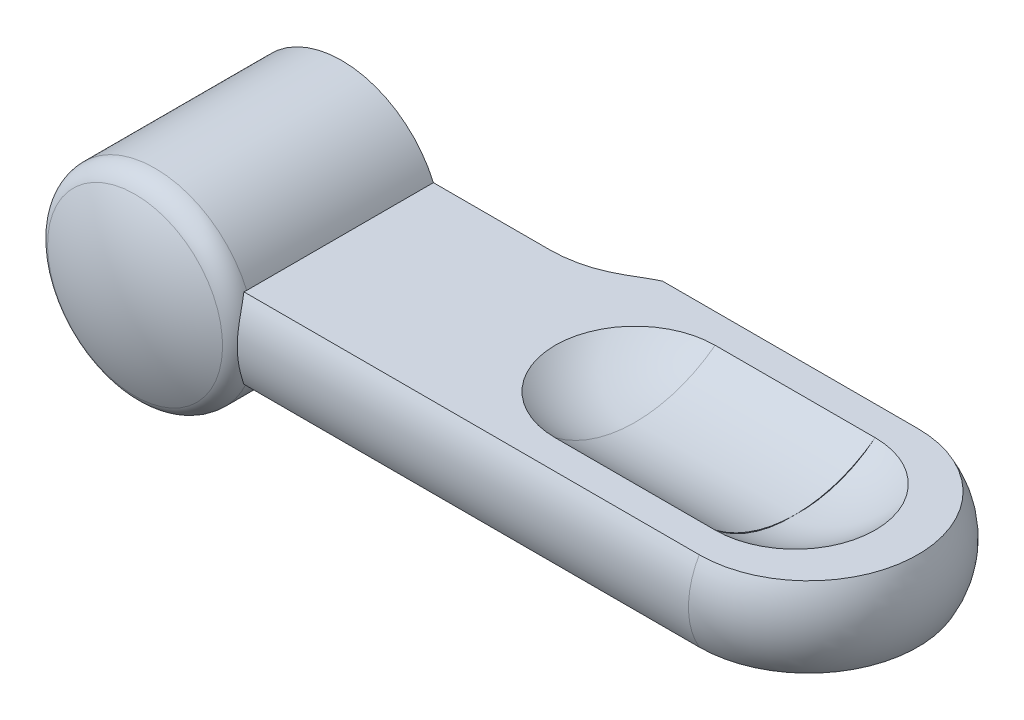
ISO-10303-21;
HEADER;
FILE_DESCRIPTION(('STEP AP214'),'2;1');
FILE_NAME('part.step','',(''),(''),'','','');
FILE_SCHEMA(('AUTOMOTIVE_DESIGN { 1 0 10303 214 1 1 1 1 }'));
ENDSEC;
DATA;
#1=APPLICATION_CONTEXT('core data for automotive mechanical design processes');
#2=APPLICATION_PROTOCOL_DEFINITION('international standard','automotive_design',2000,#1);
#3=PRODUCT_CONTEXT('',#1,'mechanical');
#4=PRODUCT('Part','Part','',(#3));
#5=PRODUCT_RELATED_PRODUCT_CATEGORY('part','',(#4));
#6=PRODUCT_DEFINITION_FORMATION('','',#4);
#7=PRODUCT_DEFINITION_CONTEXT('part definition',#1,'design');
#8=PRODUCT_DEFINITION('design','',#6,#7);
#9=PRODUCT_DEFINITION_SHAPE('','',#8);
#10=(LENGTH_UNIT() NAMED_UNIT(*) SI_UNIT(.MILLI.,.METRE.));
#11=(NAMED_UNIT(*) PLANE_ANGLE_UNIT() SI_UNIT($,.RADIAN.));
#12=(NAMED_UNIT(*) SI_UNIT($,.STERADIAN.) SOLID_ANGLE_UNIT());
#13=UNCERTAINTY_MEASURE_WITH_UNIT(LENGTH_MEASURE(1.E-05),#10,'distance_accuracy_value','');
#14=(GEOMETRIC_REPRESENTATION_CONTEXT(3) GLOBAL_UNCERTAINTY_ASSIGNED_CONTEXT((#13)) GLOBAL_UNIT_ASSIGNED_CONTEXT((#10,
#11,#12)) REPRESENTATION_CONTEXT('',''));
#15=CARTESIAN_POINT('',(0.,0.,0.));
#16=DIRECTION('',(0.,0.,1.));
#17=DIRECTION('',(1.,0.,0.));
#18=AXIS2_PLACEMENT_3D('',#15,#16,#17);
#19=CARTESIAN_POINT('',(24.,1.36152621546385,2.0197884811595));
#20=DIRECTION('',(-1.,0.,0.));
#21=DIRECTION('',(0.,-1.,0.));
#22=AXIS2_PLACEMENT_3D('',#19,#20,#21);
#23=PLANE('',#22);
#24=CARTESIAN_POINT('',(24.,0.599999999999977,3.59999999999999));
#25=CARTESIAN_POINT('',(24.,0.59698808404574,3.68072514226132));
#26=CARTESIAN_POINT('',(24.,0.595790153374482,3.7615178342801));
#27=CARTESIAN_POINT('',(24.,0.597018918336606,3.92307566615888));
#28=CARTESIAN_POINT('',(24.,0.599445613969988,4.00384080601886));
#29=CARTESIAN_POINT('',(24.,0.607920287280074,4.16518088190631));
#30=CARTESIAN_POINT('',(24.,0.613968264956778,4.24575581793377));
#31=CARTESIAN_POINT('',(24.,0.629672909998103,4.40655323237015));
#32=CARTESIAN_POINT('',(24.,0.639329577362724,4.48677571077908));
#33=CARTESIAN_POINT('',(24.,0.662232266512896,4.6467066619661));
#34=CARTESIAN_POINT('',(24.,0.675478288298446,4.72641513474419));
#35=CARTESIAN_POINT('',(24.,0.705532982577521,4.88515756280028));
#36=CARTESIAN_POINT('',(24.,0.722341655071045,4.96419151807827));
#37=CARTESIAN_POINT('',(24.,0.759487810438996,5.12142575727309));
#38=CARTESIAN_POINT('',(24.,0.779825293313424,5.19962604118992));
#39=CARTESIAN_POINT('',(24.,0.823988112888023,5.35503546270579));
#40=CARTESIAN_POINT('',(24.,0.847813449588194,5.43224460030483));
#41=CARTESIAN_POINT('',(24.,0.898903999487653,5.58551625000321));
#42=CARTESIAN_POINT('',(24.,0.92616921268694,5.66157876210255));
#43=CARTESIAN_POINT('',(24.,0.984084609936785,5.81240399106));
#44=CARTESIAN_POINT('',(24.,1.01473479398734,5.88716670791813));
#45=CARTESIAN_POINT('',(24.,1.07935841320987,6.03524179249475));
#46=CARTESIAN_POINT('',(24.,1.11333184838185,6.10855416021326));
#47=CARTESIAN_POINT('',(24.,1.18453354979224,6.25358091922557));
#48=CARTESIAN_POINT('',(24.,1.22176181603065,6.32529531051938));
#49=CARTESIAN_POINT('',(24.,1.29939823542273,6.4669816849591));
#50=CARTESIAN_POINT('',(24.,1.33980638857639,6.53695366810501));
#51=CARTESIAN_POINT('',(24.,1.42372112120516,6.67501438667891));
#52=CARTESIAN_POINT('',(24.,1.46722770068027,6.7431031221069));
#53=CARTESIAN_POINT('',(24.,1.55725200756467,6.87725998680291));
#54=CARTESIAN_POINT('',(24.,1.60376973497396,6.94332811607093));
#55=CARTESIAN_POINT('',(24.,1.69972142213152,7.07331164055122));
#56=CARTESIAN_POINT('',(24.,1.7491553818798,7.1372270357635));
#57=CARTESIAN_POINT('',(24.,1.79999999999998,7.20000000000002));
#58=B_SPLINE_CURVE_WITH_KNOTS('',3,(#24,#25,#26,#27,#28,#29,#30,#31,#32,#33,#34,#35,#36,#37,#38,
#39,#40,#41,#42,#43,#44,#45,#46,#47,#48,#49,#50,#51,#52,#53,#54,#55,#56,#57),.UNSPECIFIED.,.F.,
.F.,(4,2,2,2,2,2,2,2,2,2,2,2,2,2,2,2,4),(0.,0.242323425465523,0.484646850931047,
0.726970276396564,0.969293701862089,1.21161712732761,1.45394055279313,1.69626397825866,
1.93858740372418,2.1809108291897,2.42323425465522,2.66555768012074,2.90788110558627,
3.15020453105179,3.39252795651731,3.63485138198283,3.87717480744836),.UNSPECIFIED.);
#59=CARTESIAN_POINT('',(24.,1.8,7.2));
#60=VERTEX_POINT('',#59);
#61=CARTESIAN_POINT('',(24.,0.599999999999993,3.6));
#62=VERTEX_POINT('',#61);
#63=EDGE_CURVE('E452',#60,#62,#58,.F.);
#64=ORIENTED_EDGE('',*,*,#63,.T.);
#65=CARTESIAN_POINT('',(24.,6.6,3.6));
#66=DIRECTION('',(-1.,0.,0.));
#67=DIRECTION('',(0.,0.,1.));
#68=AXIS2_PLACEMENT_3D('',#65,#66,#67);
#69=CIRCLE('',#68,6.);
#70=EDGE_CURVE('E499',#62,#60,#69,.T.);
#71=ORIENTED_EDGE('',*,*,#70,.T.);
#72=EDGE_LOOP('',(#64,#71));
#73=FACE_BOUND('',#72,.T.);
#74=ADVANCED_FACE('F14',(#73),#23,.F.);
#75=CARTESIAN_POINT('',(16.8,1.36152621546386,2.01978848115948));
#76=DIRECTION('',(-1.,0.,0.));
#77=DIRECTION('',(0.,-1.,0.));
#78=AXIS2_PLACEMENT_3D('',#75,#76,#77);
#79=PLANE('',#78);
#80=CARTESIAN_POINT('',(16.8,6.6,3.6));
#81=DIRECTION('',(-1.,0.,0.));
#82=DIRECTION('',(0.,0.,1.));
#83=AXIS2_PLACEMENT_3D('',#80,#81,#82);
#84=CIRCLE('',#83,6.);
#85=CARTESIAN_POINT('',(16.8,1.8,7.2));
#86=VERTEX_POINT('',#85);
#87=CARTESIAN_POINT('',(16.8,0.6,3.6));
#88=VERTEX_POINT('',#87);
#89=EDGE_CURVE('E494',#86,#88,#84,.F.);
#90=ORIENTED_EDGE('',*,*,#89,.T.);
#91=CARTESIAN_POINT('',(16.8,1.8,7.20000000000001));
#92=CARTESIAN_POINT('',(16.8,1.74915538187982,7.13722703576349));
#93=CARTESIAN_POINT('',(16.8,1.69972142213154,7.07331164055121));
#94=CARTESIAN_POINT('',(16.8,1.60376973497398,6.94332811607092));
#95=CARTESIAN_POINT('',(16.8,1.55725200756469,6.87725998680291));
#96=CARTESIAN_POINT('',(16.8,1.4672277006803,6.7431031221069));
#97=CARTESIAN_POINT('',(16.8,1.42372112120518,6.67501438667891));
#98=CARTESIAN_POINT('',(16.8,1.33980638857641,6.536953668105));
#99=CARTESIAN_POINT('',(16.8,1.29939823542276,6.46698168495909));
#100=CARTESIAN_POINT('',(16.8,1.22176181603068,6.32529531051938));
#101=CARTESIAN_POINT('',(16.8,1.18453354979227,6.25358091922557));
#102=CARTESIAN_POINT('',(16.8,1.11333184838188,6.10855416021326));
#103=CARTESIAN_POINT('',(16.8,1.0793584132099,6.03524179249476));
#104=CARTESIAN_POINT('',(16.8,1.01473479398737,5.88716670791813));
#105=CARTESIAN_POINT('',(16.8,0.984084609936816,5.81240399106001));
#106=CARTESIAN_POINT('',(16.8,0.926169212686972,5.66157876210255));
#107=CARTESIAN_POINT('',(16.8,0.898903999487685,5.58551625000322));
#108=CARTESIAN_POINT('',(16.8,0.847813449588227,5.43224460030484));
#109=CARTESIAN_POINT('',(16.8,0.823988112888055,5.3550354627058));
#110=CARTESIAN_POINT('',(16.8,0.779825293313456,5.19962604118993));
#111=CARTESIAN_POINT('',(16.8,0.759487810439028,5.1214257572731));
#112=CARTESIAN_POINT('',(16.8,0.722341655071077,4.96419151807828));
#113=CARTESIAN_POINT('',(16.8,0.705532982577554,4.88515756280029));
#114=CARTESIAN_POINT('',(16.8,0.675478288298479,4.72641513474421));
#115=CARTESIAN_POINT('',(16.8,0.662232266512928,4.64670666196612));
#116=CARTESIAN_POINT('',(16.8,0.639329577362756,4.4867757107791));
#117=CARTESIAN_POINT('',(16.8,0.629672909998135,4.40655323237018));
#118=CARTESIAN_POINT('',(16.8,0.61396826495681,4.24575581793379));
#119=CARTESIAN_POINT('',(16.8,0.607920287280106,4.16518088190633));
#120=CARTESIAN_POINT('',(16.8,0.599445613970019,4.00384080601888));
#121=CARTESIAN_POINT('',(16.8,0.597018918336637,3.9230756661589));
#122=CARTESIAN_POINT('',(16.8,0.595790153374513,3.76151783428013));
#123=CARTESIAN_POINT('',(16.8,0.596988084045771,3.68072514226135));
#124=CARTESIAN_POINT('',(16.8,0.600000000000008,3.60000000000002));
#125=B_SPLINE_CURVE_WITH_KNOTS('',3,(#91,#92,#93,#94,#95,#96,#97,#98,#99,#100,#101,#102,#103,
#104,#105,#106,#107,#108,#109,#110,#111,#112,#113,#114,#115,#116,#117,#118,#119,#120,#121,#122,
#123,#124),.UNSPECIFIED.,.F.,.F.,(4,2,2,2,2,2,2,2,2,2,2,2,2,2,2,2,4),(0.,0.242323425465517,
0.484646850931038,0.726970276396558,0.969293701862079,1.2116171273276,1.45394055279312,
1.69626397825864,1.93858740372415,2.18091082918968,2.42323425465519,2.66555768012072,
2.90788110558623,3.15020453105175,3.39252795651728,3.63485138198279,3.87717480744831),.UNSPECIFIED.);
#126=EDGE_CURVE('E245',#88,#86,#125,.F.);
#127=ORIENTED_EDGE('',*,*,#126,.T.);
#128=EDGE_LOOP('',(#90,#127));
#129=FACE_BOUND('',#128,.T.);
#130=ADVANCED_FACE('F639',(#129),#79,.T.);
#131=CARTESIAN_POINT('',(16.8,1.36152621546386,2.01978848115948));
#132=DIRECTION('',(-1.,0.,0.));
#133=DIRECTION('',(0.,-1.,0.));
#134=AXIS2_PLACEMENT_3D('',#131,#132,#133);
#135=PLANE('',#134);
#136=CARTESIAN_POINT('',(16.8,6.6,3.6));
#137=DIRECTION('',(-1.,0.,0.));
#138=DIRECTION('',(0.,0.,1.));
#139=AXIS2_PLACEMENT_3D('',#136,#137,#138);
#140=CIRCLE('',#139,6.);
#141=CARTESIAN_POINT('',(16.8,1.8,0.));
#142=VERTEX_POINT('',#141);
#143=EDGE_CURVE('E490',#88,#142,#140,.F.);
#144=ORIENTED_EDGE('',*,*,#143,.T.);
#145=CARTESIAN_POINT('',(16.8,0.600000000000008,3.59999999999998));
#146=CARTESIAN_POINT('',(16.8,0.596988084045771,3.51927485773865));
#147=CARTESIAN_POINT('',(16.8,0.595790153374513,3.43848216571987));
#148=CARTESIAN_POINT('',(16.8,0.597018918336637,3.2769243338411));
#149=CARTESIAN_POINT('',(16.8,0.599445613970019,3.19615919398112));
#150=CARTESIAN_POINT('',(16.8,0.607920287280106,3.03481911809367));
#151=CARTESIAN_POINT('',(16.8,0.61396826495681,2.95424418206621));
#152=CARTESIAN_POINT('',(16.8,0.629672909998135,2.79344676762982));
#153=CARTESIAN_POINT('',(16.8,0.639329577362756,2.7132242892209));
#154=CARTESIAN_POINT('',(16.8,0.662232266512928,2.55329333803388));
#155=CARTESIAN_POINT('',(16.8,0.675478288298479,2.47358486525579));
#156=CARTESIAN_POINT('',(16.8,0.705532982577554,2.31484243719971));
#157=CARTESIAN_POINT('',(16.8,0.722341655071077,2.23580848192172));
#158=CARTESIAN_POINT('',(16.8,0.759487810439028,2.0785742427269));
#159=CARTESIAN_POINT('',(16.8,0.779825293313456,2.00037395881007));
#160=CARTESIAN_POINT('',(16.8,0.823988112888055,1.8449645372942));
#161=CARTESIAN_POINT('',(16.8,0.847813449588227,1.76775539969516));
#162=CARTESIAN_POINT('',(16.8,0.898903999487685,1.61448374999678));
#163=CARTESIAN_POINT('',(16.8,0.926169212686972,1.53842123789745));
#164=CARTESIAN_POINT('',(16.8,0.984084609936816,1.38759600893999));
#165=CARTESIAN_POINT('',(16.8,1.01473479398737,1.31283329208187));
#166=CARTESIAN_POINT('',(16.8,1.0793584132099,1.16475820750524));
#167=CARTESIAN_POINT('',(16.8,1.11333184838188,1.09144583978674));
#168=CARTESIAN_POINT('',(16.8,1.18453354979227,0.946419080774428));
#169=CARTESIAN_POINT('',(16.8,1.22176181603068,0.874704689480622));
#170=CARTESIAN_POINT('',(16.8,1.29939823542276,0.733018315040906));
#171=CARTESIAN_POINT('',(16.8,1.33980638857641,0.663046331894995));
#172=CARTESIAN_POINT('',(16.8,1.42372112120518,0.524985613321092));
#173=CARTESIAN_POINT('',(16.8,1.4672277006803,0.456896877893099));
#174=CARTESIAN_POINT('',(16.8,1.55725200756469,0.322740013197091));
#175=CARTESIAN_POINT('',(16.8,1.60376973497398,0.256671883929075));
#176=CARTESIAN_POINT('',(16.8,1.69972142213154,0.126688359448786));
#177=CARTESIAN_POINT('',(16.8,1.74915538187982,0.0627729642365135));
#178=CARTESIAN_POINT('',(16.8,1.8,0.));
#179=B_SPLINE_CURVE_WITH_KNOTS('',3,(#145,#146,#147,#148,#149,#150,#151,#152,#153,#154,#155,
#156,#157,#158,#159,#160,#161,#162,#163,#164,#165,#166,#167,#168,#169,#170,#171,#172,#173,#174,
#175,#176,#177,#178),.UNSPECIFIED.,.F.,.F.,(4,2,2,2,2,2,2,2,2,2,2,2,2,2,2,2,4),(0.,
0.24232342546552,0.484646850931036,0.726970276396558,0.969293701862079,1.2116171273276,
1.45394055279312,1.69626397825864,1.93858740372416,2.18091082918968,2.4232342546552,
2.66555768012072,2.90788110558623,3.15020453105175,3.39252795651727,3.6348513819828,
3.87717480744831),.UNSPECIFIED.);
#180=EDGE_CURVE('E428',#142,#88,#179,.F.);
#181=ORIENTED_EDGE('',*,*,#180,.T.);
#182=EDGE_LOOP('',(#144,#181));
#183=FACE_BOUND('',#182,.T.);
#184=ADVANCED_FACE('F641',(#183),#135,.T.);
#185=CARTESIAN_POINT('',(24.,1.36152621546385,2.0197884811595));
#186=DIRECTION('',(-1.,0.,0.));
#187=DIRECTION('',(0.,-1.,0.));
#188=AXIS2_PLACEMENT_3D('',#185,#186,#187);
#189=PLANE('',#188);
#190=CARTESIAN_POINT('',(24.0000000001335,1.79999999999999,0.));
#191=CARTESIAN_POINT('',(24.0000000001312,1.7491553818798,0.0627729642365));
#192=CARTESIAN_POINT('',(24.0000000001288,1.69972142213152,0.126688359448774));
#193=CARTESIAN_POINT('',(24.000000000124,1.60376973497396,0.256671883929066));
#194=CARTESIAN_POINT('',(24.0000000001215,1.55725200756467,0.322740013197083));
#195=CARTESIAN_POINT('',(24.0000000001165,1.46722770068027,0.456896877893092));
#196=CARTESIAN_POINT('',(24.000000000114,1.42372112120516,0.524985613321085));
#197=CARTESIAN_POINT('',(24.0000000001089,1.33980638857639,0.663046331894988));
#198=CARTESIAN_POINT('',(24.0000000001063,1.29939823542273,0.733018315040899));
#199=CARTESIAN_POINT('',(24.0000000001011,1.22176181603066,0.874704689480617));
#200=CARTESIAN_POINT('',(24.0000000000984,1.18453354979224,0.946419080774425));
#201=CARTESIAN_POINT('',(24.000000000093,1.11333184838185,1.09144583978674));
#202=CARTESIAN_POINT('',(24.0000000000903,1.07935841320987,1.16475820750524));
#203=CARTESIAN_POINT('',(24.0000000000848,1.01473479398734,1.31283329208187));
#204=CARTESIAN_POINT('',(24.000000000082,0.984084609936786,1.38759600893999));
#205=CARTESIAN_POINT('',(24.0000000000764,0.926169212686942,1.53842123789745));
#206=CARTESIAN_POINT('',(24.0000000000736,0.898903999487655,1.61448374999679));
#207=CARTESIAN_POINT('',(24.0000000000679,0.847813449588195,1.76775539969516));
#208=CARTESIAN_POINT('',(24.0000000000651,0.823988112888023,1.8449645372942));
#209=CARTESIAN_POINT('',(24.0000000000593,0.779825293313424,2.00037395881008));
#210=CARTESIAN_POINT('',(24.0000000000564,0.759487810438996,2.07857424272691));
#211=CARTESIAN_POINT('',(24.0000000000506,0.722341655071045,2.23580848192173));
#212=CARTESIAN_POINT('',(24.0000000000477,0.705532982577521,2.31484243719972));
#213=CARTESIAN_POINT('',(24.0000000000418,0.675478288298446,2.47358486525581));
#214=CARTESIAN_POINT('',(24.0000000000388,0.662232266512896,2.5532933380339));
#215=CARTESIAN_POINT('',(24.0000000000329,0.639329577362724,2.71322428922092));
#216=CARTESIAN_POINT('',(24.0000000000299,0.629672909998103,2.79344676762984));
#217=CARTESIAN_POINT('',(24.0000000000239,0.613968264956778,2.95424418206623));
#218=CARTESIAN_POINT('',(24.000000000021,0.607920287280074,3.03481911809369));
#219=CARTESIAN_POINT('',(24.000000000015,0.599445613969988,3.19615919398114));
#220=CARTESIAN_POINT('',(24.000000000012,0.597018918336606,3.27692433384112));
#221=CARTESIAN_POINT('',(24.000000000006,0.595790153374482,3.4384821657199));
#222=CARTESIAN_POINT('',(24.000000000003,0.59698808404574,3.51927485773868));
#223=CARTESIAN_POINT('',(24.,0.599999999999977,3.60000000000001));
#224=B_SPLINE_CURVE_WITH_KNOTS('',3,(#190,#191,#192,#193,#194,#195,#196,#197,#198,#199,#200,
#201,#202,#203,#204,#205,#206,#207,#208,#209,#210,#211,#212,#213,#214,#215,#216,#217,#218,#219,
#220,#221,#222,#223),.UNSPECIFIED.,.F.,.F.,(4,2,2,2,2,2,2,2,2,2,2,2,2,2,2,2,4),(0.,
0.242323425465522,0.484646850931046,0.726970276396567,0.969293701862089,1.21161712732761,
1.45394055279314,1.69626397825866,1.93858740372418,2.1809108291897,2.42323425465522,
2.66555768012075,2.90788110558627,3.15020453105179,3.39252795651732,3.63485138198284,
3.87717480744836),.UNSPECIFIED.);
#225=CARTESIAN_POINT('',(24.0000000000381,1.8,0.));
#226=VERTEX_POINT('',#225);
#227=EDGE_CURVE('E505',#62,#226,#224,.F.);
#228=ORIENTED_EDGE('',*,*,#227,.T.);
#229=CARTESIAN_POINT('',(24.,6.6,3.6));
#230=DIRECTION('',(-1.,0.,0.));
#231=DIRECTION('',(0.,0.,1.));
#232=AXIS2_PLACEMENT_3D('',#229,#230,#231);
#233=CIRCLE('',#232,6.);
#234=EDGE_CURVE('E239',#226,#62,#233,.T.);
#235=ORIENTED_EDGE('',*,*,#234,.T.);
#236=EDGE_LOOP('',(#228,#235));
#237=FACE_BOUND('',#236,.T.);
#238=ADVANCED_FACE('F648',(#237),#189,.F.);
#239=CARTESIAN_POINT('',(0.,0.,3.5));
#240=DIRECTION('',(0.,0.,-1.));
#241=DIRECTION('',(0.,1.,0.));
#242=AXIS2_PLACEMENT_3D('',#239,#240,#241);
#243=CYLINDRICAL_SURFACE('',#242,2.5);
#244=CARTESIAN_POINT('',(0.,0.,0.499999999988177));
#245=DIRECTION('',(0.,0.,-1.));
#246=DIRECTION('',(1.,0.,0.));
#247=AXIS2_PLACEMENT_3D('',#244,#245,#246);
#248=CIRCLE('',#247,2.49999999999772);
#249=CARTESIAN_POINT('',(2.49999999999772,0.,0.499999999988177));
#250=VERTEX_POINT('',#249);
#251=EDGE_CURVE('E232',#250,#250,#248,.T.);
#252=ORIENTED_EDGE('',*,*,#251,.T.);
#253=EDGE_LOOP('',(#252));
#254=FACE_BOUND('',#253,.T.);
#255=CARTESIAN_POINT('',(0.,0.,6.5));
#256=DIRECTION('',(0.,0.,-1.));
#257=DIRECTION('',(0.,1.,0.));
#258=AXIS2_PLACEMENT_3D('',#255,#256,#257);
#259=CIRCLE('',#258,2.5);
#260=CARTESIAN_POINT('',(0.,2.5,6.5));
#261=VERTEX_POINT('',#260);
#262=EDGE_CURVE('E511',#261,#261,#259,.T.);
#263=ORIENTED_EDGE('',*,*,#262,.F.);
#264=EDGE_LOOP('',(#263));
#265=FACE_BOUND('',#264,.T.);
#266=ADVANCED_FACE('F695',(#254,#265),#243,.F.);
#267=CARTESIAN_POINT('',(0.,0.0100014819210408,1.20000555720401));
#268=DIRECTION('',(1.,0.,0.));
#269=DIRECTION('',(0.,1.,0.));
#270=AXIS2_PLACEMENT_3D('',#267,#268,#269);
#271=CIRCLE('',#270,9.);
#272=TRIMMED_CURVE('',#271,(PARAMETER_VALUE(-1.57190760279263)),
(PARAMETER_VALUE(1.57190760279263)),.T.,.PARAMETER.);
#273=CARTESIAN_POINT('',(0.,0.,1.20000555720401));
#274=DIRECTION('',(0.,0.,-1.));
#275=AXIS1_PLACEMENT('',#273,#274);
#276=SURFACE_OF_REVOLUTION('',#272,#275);
#277=CARTESIAN_POINT('',(0.,0.,9.29843590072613));
#278=DIRECTION('',(0.,0.,-1.));
#279=DIRECTION('',(0.,1.,0.));
#280=AXIS2_PLACEMENT_3D('',#277,#278,#279);
#281=CIRCLE('',#280,3.93624981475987);
#282=CARTESIAN_POINT('',(0.,3.93624981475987,9.29843590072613));
#283=VERTEX_POINT('',#282);
#284=EDGE_CURVE('E229',#283,#283,#281,.T.);
#285=ORIENTED_EDGE('',*,*,#284,.F.);
#286=EDGE_LOOP('',(#285));
#287=FACE_BOUND('',#286,.T.);
#288=CARTESIAN_POINT('',(0.,0.,10.2));
#289=VERTEX_POINT('',#288);
#290=VERTEX_LOOP('',#289);
#291=FACE_BOUND('',#290,.T.);
#292=ADVANCED_FACE('F704',(#287,#291),#276,.F.);
#293=CARTESIAN_POINT('',(23.7987495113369,5.9962485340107,3.6));
#294=DIRECTION('',(0.,0.,1.));
#295=DIRECTION('',(-1.,0.,0.));
#296=AXIS2_PLACEMENT_3D('',#293,#294,#295);
#297=CIRCLE('',#296,5.4);
#298=TRIMMED_CURVE('',#297,(PARAMETER_VALUE(-1.60807356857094)),
(PARAMETER_VALUE(1.60807356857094)),.T.,.PARAMETER.);
#299=CARTESIAN_POINT('',(24.,5.9962485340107,3.6));
#300=DIRECTION('',(0.,1.,0.));
#301=AXIS1_PLACEMENT('',#299,#300);
#302=SURFACE_OF_REVOLUTION('',#298,#301);
#303=CARTESIAN_POINT('',(24.,1.79999999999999,3.6));
#304=DIRECTION('',(0.,1.,0.));
#305=DIRECTION('',(1.,0.,0.));
#306=AXIS2_PLACEMENT_3D('',#303,#304,#305);
#307=CIRCLE('',#306,3.60000000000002);
#308=CARTESIAN_POINT('',(27.6,1.8,3.6));
#309=VERTEX_POINT('',#308);
#310=EDGE_CURVE('E607',#309,#226,#307,.T.);
#311=ORIENTED_EDGE('',*,*,#310,.T.);
#312=ORIENTED_EDGE('',*,*,#227,.F.);
#313=ORIENTED_EDGE('',*,*,#63,.F.);
#314=CARTESIAN_POINT('',(24.,1.79999999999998,3.6));
#315=DIRECTION('',(0.,1.,0.));
#316=DIRECTION('',(0.,0.,1.));
#317=AXIS2_PLACEMENT_3D('',#314,#315,#316);
#318=CIRCLE('',#317,3.60000000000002);
#319=EDGE_CURVE('E465',#60,#309,#318,.T.);
#320=ORIENTED_EDGE('',*,*,#319,.T.);
#321=EDGE_LOOP('',(#311,#312,#313,#320));
#322=FACE_BOUND('',#321,.T.);
#323=ADVANCED_FACE('F263',(#322),#302,.T.);
#324=CARTESIAN_POINT('',(17.0012504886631,5.99624853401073,3.6));
#325=DIRECTION('',(0.,0.,1.));
#326=DIRECTION('',(1.,0.,0.));
#327=AXIS2_PLACEMENT_3D('',#324,#325,#326);
#328=CIRCLE('',#327,5.4);
#329=TRIMMED_CURVE('',#328,(PARAMETER_VALUE(-1.60807356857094)),
(PARAMETER_VALUE(1.60807356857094)),.T.,.PARAMETER.);
#330=CARTESIAN_POINT('',(16.8,5.99624853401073,3.6));
#331=DIRECTION('',(0.,-1.,0.));
#332=AXIS1_PLACEMENT('',#330,#331);
#333=SURFACE_OF_REVOLUTION('',#329,#332);
#334=CARTESIAN_POINT('',(16.8,1.8,3.6));
#335=DIRECTION('',(0.,1.,0.));
#336=DIRECTION('',(-1.,0.,0.));
#337=AXIS2_PLACEMENT_3D('',#334,#335,#336);
#338=CIRCLE('',#337,3.60000000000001);
#339=CARTESIAN_POINT('',(13.2,1.8,3.60000000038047));
#340=VERTEX_POINT('',#339);
#341=EDGE_CURVE('E603',#340,#86,#338,.T.);
#342=ORIENTED_EDGE('',*,*,#341,.T.);
#343=ORIENTED_EDGE('',*,*,#126,.F.);
#344=ORIENTED_EDGE('',*,*,#180,.F.);
#345=CARTESIAN_POINT('',(16.8,1.8,3.6));
#346=DIRECTION('',(0.,1.,0.));
#347=DIRECTION('',(0.,0.,-1.));
#348=AXIS2_PLACEMENT_3D('',#345,#346,#347);
#349=CIRCLE('',#348,3.60000000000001);
#350=EDGE_CURVE('E439',#142,#340,#349,.T.);
#351=ORIENTED_EDGE('',*,*,#350,.T.);
#352=EDGE_LOOP('',(#342,#343,#344,#351));
#353=FACE_BOUND('',#352,.T.);
#354=ADVANCED_FACE('F252',(#353),#333,.T.);
#355=CARTESIAN_POINT('',(16.8,6.6,3.6));
#356=DIRECTION('',(-1.,0.,0.));
#357=DIRECTION('',(0.,-1.,0.));
#358=AXIS2_PLACEMENT_3D('',#355,#356,#357);
#359=CYLINDRICAL_SURFACE('',#358,6.);
#360=DIRECTION('',(1.,0.,0.));
#361=VECTOR('',#360,1.);
#362=CARTESIAN_POINT('',(0.,1.8,0.));
#363=LINE('',#362,#361);
#364=EDGE_CURVE('E605',#226,#142,#363,.F.);
#365=ORIENTED_EDGE('',*,*,#364,.T.);
#366=ORIENTED_EDGE('',*,*,#143,.F.);
#367=ORIENTED_EDGE('',*,*,#89,.F.);
#368=DIRECTION('',(1.,0.,0.));
#369=VECTOR('',#368,1.);
#370=CARTESIAN_POINT('',(0.,1.8,7.2));
#371=LINE('',#370,#369);
#372=EDGE_CURVE('E601',#86,#60,#371,.T.);
#373=ORIENTED_EDGE('',*,*,#372,.T.);
#374=ORIENTED_EDGE('',*,*,#70,.F.);
#375=ORIENTED_EDGE('',*,*,#234,.F.);
#376=EDGE_LOOP('',(#365,#366,#367,#373,#374,#375));
#377=FACE_BOUND('',#376,.T.);
#378=ADVANCED_FACE('F262',(#377),#359,.F.);
#379=CARTESIAN_POINT('',(24.,-1.36152621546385,2.0197884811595));
#380=DIRECTION('',(-1.,0.,0.));
#381=DIRECTION('',(0.,-1.,0.));
#382=AXIS2_PLACEMENT_3D('',#379,#380,#381);
#383=PLANE('',#382);
#384=CARTESIAN_POINT('',(24.,-0.599999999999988,3.60000000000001));
#385=CARTESIAN_POINT('',(24.,-0.59698808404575,3.51927485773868));
#386=CARTESIAN_POINT('',(24.,-0.595790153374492,3.4384821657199));
#387=CARTESIAN_POINT('',(24.,-0.597018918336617,3.27692433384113));
#388=CARTESIAN_POINT('',(24.,-0.599445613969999,3.19615919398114));
#389=CARTESIAN_POINT('',(24.,-0.607920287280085,3.0348191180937));
#390=CARTESIAN_POINT('',(24.,-0.613968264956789,2.95424418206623));
#391=CARTESIAN_POINT('',(24.,-0.629672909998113,2.79344676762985));
#392=CARTESIAN_POINT('',(24.,-0.639329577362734,2.71322428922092));
#393=CARTESIAN_POINT('',(24.,-0.662232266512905,2.5532933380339));
#394=CARTESIAN_POINT('',(24.,-0.675478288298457,2.47358486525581));
#395=CARTESIAN_POINT('',(24.,-0.705532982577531,2.31484243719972));
#396=CARTESIAN_POINT('',(24.,-0.722341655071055,2.23580848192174));
#397=CARTESIAN_POINT('',(24.,-0.759487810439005,2.07857424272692));
#398=CARTESIAN_POINT('',(24.,-0.779825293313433,2.00037395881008));
#399=CARTESIAN_POINT('',(24.,-0.823988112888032,1.84496453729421));
#400=CARTESIAN_POINT('',(24.,-0.847813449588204,1.76775539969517));
#401=CARTESIAN_POINT('',(24.,-0.898903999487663,1.61448374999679));
#402=CARTESIAN_POINT('',(24.,-0.92616921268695,1.53842123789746));
#403=CARTESIAN_POINT('',(24.,-0.984084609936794,1.38759600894));
#404=CARTESIAN_POINT('',(24.,-1.01473479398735,1.31283329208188));
#405=CARTESIAN_POINT('',(24.,-1.07935841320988,1.16475820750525));
#406=CARTESIAN_POINT('',(24.,-1.11333184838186,1.09144583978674));
#407=CARTESIAN_POINT('',(24.,-1.18453354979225,0.946419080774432));
#408=CARTESIAN_POINT('',(24.,-1.22176181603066,0.874704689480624));
#409=CARTESIAN_POINT('',(24.,-1.29939823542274,0.733018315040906));
#410=CARTESIAN_POINT('',(24.,-1.33980638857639,0.663046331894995));
#411=CARTESIAN_POINT('',(24.,-1.42372112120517,0.524985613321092));
#412=CARTESIAN_POINT('',(24.,-1.46722770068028,0.456896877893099));
#413=CARTESIAN_POINT('',(24.,-1.55725200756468,0.322740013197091));
#414=CARTESIAN_POINT('',(24.,-1.60376973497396,0.256671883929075));
#415=CARTESIAN_POINT('',(24.,-1.69972142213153,0.126688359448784));
#416=CARTESIAN_POINT('',(24.,-1.74915538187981,0.0627729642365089));
#417=CARTESIAN_POINT('',(24.,-1.79999999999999,0.));
#418=B_SPLINE_CURVE_WITH_KNOTS('',3,(#384,#385,#386,#387,#388,#389,#390,#391,#392,#393,#394,
#395,#396,#397,#398,#399,#400,#401,#402,#403,#404,#405,#406,#407,#408,#409,#410,#411,#412,#413,
#414,#415,#416,#417),.UNSPECIFIED.,.F.,.F.,(4,2,2,2,2,2,2,2,2,2,2,2,2,2,2,2,4),(0.,
0.242323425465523,0.484646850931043,0.726970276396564,0.969293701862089,1.21161712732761,
1.45394055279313,1.69626397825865,1.93858740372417,2.1809108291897,2.42323425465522,
2.66555768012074,2.90788110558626,3.15020453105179,3.39252795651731,3.63485138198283,
3.87717480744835),.UNSPECIFIED.);
#419=CARTESIAN_POINT('',(24.,-1.8,0.));
#420=VERTEX_POINT('',#419);
#421=CARTESIAN_POINT('',(24.,-0.6,3.6));
#422=VERTEX_POINT('',#421);
#423=EDGE_CURVE('E279',#420,#422,#418,.F.);
#424=ORIENTED_EDGE('',*,*,#423,.T.);
#425=CARTESIAN_POINT('',(24.,-6.6,3.6));
#426=DIRECTION('',(-1.,0.,0.));
#427=DIRECTION('',(0.,0.,1.));
#428=AXIS2_PLACEMENT_3D('',#425,#426,#427);
#429=CIRCLE('',#428,6.);
#430=EDGE_CURVE('E325',#422,#420,#429,.T.);
#431=ORIENTED_EDGE('',*,*,#430,.T.);
#432=EDGE_LOOP('',(#424,#431));
#433=FACE_BOUND('',#432,.T.);
#434=ADVANCED_FACE('F285',(#433),#383,.F.);
#435=CARTESIAN_POINT('',(24.,-1.36152621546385,2.0197884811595));
#436=DIRECTION('',(-1.,0.,0.));
#437=DIRECTION('',(0.,-1.,0.));
#438=AXIS2_PLACEMENT_3D('',#435,#436,#437);
#439=PLANE('',#438);
#440=CARTESIAN_POINT('',(24.0000000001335,-1.79999999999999,7.20000000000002));
#441=CARTESIAN_POINT('',(24.0000000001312,-1.74915538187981,7.1372270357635));
#442=CARTESIAN_POINT('',(24.0000000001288,-1.69972142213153,7.07331164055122));
#443=CARTESIAN_POINT('',(24.000000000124,-1.60376973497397,6.94332811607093));
#444=CARTESIAN_POINT('',(24.0000000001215,-1.55725200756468,6.87725998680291));
#445=CARTESIAN_POINT('',(24.0000000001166,-1.46722770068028,6.7431031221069));
#446=CARTESIAN_POINT('',(24.000000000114,-1.42372112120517,6.67501438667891));
#447=CARTESIAN_POINT('',(24.0000000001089,-1.3398063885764,6.53695366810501));
#448=CARTESIAN_POINT('',(24.0000000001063,-1.29939823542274,6.4669816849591));
#449=CARTESIAN_POINT('',(24.0000000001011,-1.22176181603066,6.32529531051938));
#450=CARTESIAN_POINT('',(24.0000000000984,-1.18453354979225,6.25358091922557));
#451=CARTESIAN_POINT('',(24.000000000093,-1.11333184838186,6.10855416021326));
#452=CARTESIAN_POINT('',(24.0000000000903,-1.07935841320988,6.03524179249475));
#453=CARTESIAN_POINT('',(24.0000000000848,-1.01473479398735,5.88716670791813));
#454=CARTESIAN_POINT('',(24.000000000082,-0.984084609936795,5.81240399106));
#455=CARTESIAN_POINT('',(24.0000000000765,-0.926169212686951,5.66157876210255));
#456=CARTESIAN_POINT('',(24.0000000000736,-0.898903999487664,5.58551625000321));
#457=CARTESIAN_POINT('',(24.0000000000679,-0.847813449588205,5.43224460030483));
#458=CARTESIAN_POINT('',(24.0000000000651,-0.823988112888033,5.35503546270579));
#459=CARTESIAN_POINT('',(24.0000000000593,-0.779825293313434,5.19962604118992));
#460=CARTESIAN_POINT('',(24.0000000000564,-0.759487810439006,5.12142575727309));
#461=CARTESIAN_POINT('',(24.0000000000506,-0.722341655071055,4.96419151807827));
#462=CARTESIAN_POINT('',(24.0000000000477,-0.705532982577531,4.88515756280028));
#463=CARTESIAN_POINT('',(24.0000000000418,-0.675478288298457,4.72641513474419));
#464=CARTESIAN_POINT('',(24.0000000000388,-0.662232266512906,4.6467066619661));
#465=CARTESIAN_POINT('',(24.0000000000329,-0.639329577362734,4.48677571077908));
#466=CARTESIAN_POINT('',(24.0000000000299,-0.629672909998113,4.40655323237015));
#467=CARTESIAN_POINT('',(24.0000000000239,-0.613968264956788,4.24575581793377));
#468=CARTESIAN_POINT('',(24.000000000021,-0.607920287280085,4.16518088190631));
#469=CARTESIAN_POINT('',(24.000000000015,-0.599445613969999,4.00384080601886));
#470=CARTESIAN_POINT('',(24.000000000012,-0.597018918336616,3.92307566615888));
#471=CARTESIAN_POINT('',(24.000000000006,-0.595790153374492,3.7615178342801));
#472=CARTESIAN_POINT('',(24.000000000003,-0.59698808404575,3.68072514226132));
#473=CARTESIAN_POINT('',(24.,-0.599999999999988,3.59999999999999));
#474=B_SPLINE_CURVE_WITH_KNOTS('',3,(#440,#441,#442,#443,#444,#445,#446,#447,#448,#449,#450,
#451,#452,#453,#454,#455,#456,#457,#458,#459,#460,#461,#462,#463,#464,#465,#466,#467,#468,#469,
#470,#471,#472,#473),.UNSPECIFIED.,.F.,.F.,(4,2,2,2,2,2,2,2,2,2,2,2,2,2,2,2,4),(0.,
0.242323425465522,0.484646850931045,0.726970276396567,0.969293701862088,1.21161712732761,
1.45394055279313,1.69626397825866,1.93858740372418,2.1809108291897,2.42323425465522,
2.66555768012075,2.90788110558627,3.15020453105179,3.39252795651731,3.63485138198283,
3.87717480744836),.UNSPECIFIED.);
#475=CARTESIAN_POINT('',(24.0000000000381,-1.8,7.2));
#476=VERTEX_POINT('',#475);
#477=EDGE_CURVE('E418',#422,#476,#474,.F.);
#478=ORIENTED_EDGE('',*,*,#477,.T.);
#479=CARTESIAN_POINT('',(24.,-6.6,3.6));
#480=DIRECTION('',(-1.,0.,0.));
#481=DIRECTION('',(0.,0.,1.));
#482=AXIS2_PLACEMENT_3D('',#479,#480,#481);
#483=CIRCLE('',#482,6.);
#484=EDGE_CURVE('E315',#476,#422,#483,.T.);
#485=ORIENTED_EDGE('',*,*,#484,.T.);
#486=EDGE_LOOP('',(#478,#485));
#487=FACE_BOUND('',#486,.T.);
#488=ADVANCED_FACE('F294',(#487),#439,.F.);
#489=CARTESIAN_POINT('',(16.8,-1.36152621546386,2.01978848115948));
#490=DIRECTION('',(-1.,0.,0.));
#491=DIRECTION('',(0.,0.,-1.));
#492=AXIS2_PLACEMENT_3D('',#489,#490,#491);
#493=PLANE('',#492);
#494=CARTESIAN_POINT('',(16.8,-6.6,3.6));
#495=DIRECTION('',(-1.,0.,0.));
#496=DIRECTION('',(0.,0.,1.));
#497=AXIS2_PLACEMENT_3D('',#494,#495,#496);
#498=CIRCLE('',#497,6.);
#499=CARTESIAN_POINT('',(16.8,-1.8,0.));
#500=VERTEX_POINT('',#499);
#501=CARTESIAN_POINT('',(16.8,-0.6,3.6));
#502=VERTEX_POINT('',#501);
#503=EDGE_CURVE('E123',#500,#502,#498,.F.);
#504=ORIENTED_EDGE('',*,*,#503,.T.);
#505=CARTESIAN_POINT('',(16.8,-1.79999999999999,0.));
#506=CARTESIAN_POINT('',(16.8,-1.74915538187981,0.0627729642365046));
#507=CARTESIAN_POINT('',(16.8,-1.69972142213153,0.126688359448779));
#508=CARTESIAN_POINT('',(16.8,-1.60376973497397,0.256671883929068));
#509=CARTESIAN_POINT('',(16.8,-1.55725200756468,0.322740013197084));
#510=CARTESIAN_POINT('',(16.8,-1.46722770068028,0.456896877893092));
#511=CARTESIAN_POINT('',(16.8,-1.42372112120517,0.524985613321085));
#512=CARTESIAN_POINT('',(16.8,-1.3398063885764,0.663046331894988));
#513=CARTESIAN_POINT('',(16.8,-1.29939823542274,0.733018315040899));
#514=CARTESIAN_POINT('',(16.8,-1.22176181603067,0.874704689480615));
#515=CARTESIAN_POINT('',(16.8,-1.18453354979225,0.946419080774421));
#516=CARTESIAN_POINT('',(16.8,-1.11333184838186,1.09144583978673));
#517=CARTESIAN_POINT('',(16.8,-1.07935841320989,1.16475820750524));
#518=CARTESIAN_POINT('',(16.8,-1.01473479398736,1.31283329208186));
#519=CARTESIAN_POINT('',(16.8,-0.984084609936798,1.38759600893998));
#520=CARTESIAN_POINT('',(16.8,-0.926169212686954,1.53842123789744));
#521=CARTESIAN_POINT('',(16.8,-0.898903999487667,1.61448374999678));
#522=CARTESIAN_POINT('',(16.8,-0.847813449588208,1.76775539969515));
#523=CARTESIAN_POINT('',(16.8,-0.823988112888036,1.84496453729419));
#524=CARTESIAN_POINT('',(16.8,-0.779825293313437,2.00037395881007));
#525=CARTESIAN_POINT('',(16.8,-0.759487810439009,2.0785742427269));
#526=CARTESIAN_POINT('',(16.8,-0.722341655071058,2.23580848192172));
#527=CARTESIAN_POINT('',(16.8,-0.705532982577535,2.3148424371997));
#528=CARTESIAN_POINT('',(16.8,-0.67547828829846,2.47358486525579));
#529=CARTESIAN_POINT('',(16.8,-0.662232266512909,2.55329333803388));
#530=CARTESIAN_POINT('',(16.8,-0.639329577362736,2.7132242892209));
#531=CARTESIAN_POINT('',(16.8,-0.629672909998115,2.79344676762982));
#532=CARTESIAN_POINT('',(16.8,-0.61396826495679,2.9542441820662));
#533=CARTESIAN_POINT('',(16.8,-0.607920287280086,3.03481911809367));
#534=CARTESIAN_POINT('',(16.8,-0.59944561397,3.19615919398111));
#535=CARTESIAN_POINT('',(16.8,-0.597018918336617,3.2769243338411));
#536=CARTESIAN_POINT('',(16.8,-0.595790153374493,3.43848216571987));
#537=CARTESIAN_POINT('',(16.8,-0.596988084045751,3.51927485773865));
#538=CARTESIAN_POINT('',(16.8,-0.599999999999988,3.59999999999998));
#539=B_SPLINE_CURVE_WITH_KNOTS('',3,(#505,#506,#507,#508,#509,#510,#511,#512,#513,#514,#515,
#516,#517,#518,#519,#520,#521,#522,#523,#524,#525,#526,#527,#528,#529,#530,#531,#532,#533,#534,
#535,#536,#537,#538),.UNSPECIFIED.,.F.,.F.,(4,2,2,2,2,2,2,2,2,2,2,2,2,2,2,2,4),(0.,
0.242323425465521,0.484646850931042,0.726970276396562,0.969293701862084,1.2116171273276,
1.45394055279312,1.69626397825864,1.93858740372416,2.18091082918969,2.4232342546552,
2.66555768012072,2.90788110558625,3.15020453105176,3.39252795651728,3.6348513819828,
3.87717480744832),.UNSPECIFIED.);
#540=EDGE_CURVE('E308',#502,#500,#539,.F.);
#541=ORIENTED_EDGE('',*,*,#540,.T.);
#542=EDGE_LOOP('',(#504,#541));
#543=FACE_BOUND('',#542,.T.);
#544=ADVANCED_FACE('F297',(#543),#493,.T.);
#545=CARTESIAN_POINT('',(16.8,-1.36152621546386,2.01978848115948));
#546=DIRECTION('',(-1.,0.,0.));
#547=DIRECTION('',(0.,0.,-1.));
#548=AXIS2_PLACEMENT_3D('',#545,#546,#547);
#549=PLANE('',#548);
#550=CARTESIAN_POINT('',(16.8,-6.6,3.6));
#551=DIRECTION('',(-1.,0.,0.));
#552=DIRECTION('',(0.,0.,1.));
#553=AXIS2_PLACEMENT_3D('',#550,#551,#552);
#554=CIRCLE('',#553,6.);
#555=CARTESIAN_POINT('',(16.8,-1.8,7.2));
#556=VERTEX_POINT('',#555);
#557=EDGE_CURVE('E324',#502,#556,#554,.F.);
#558=ORIENTED_EDGE('',*,*,#557,.T.);
#559=CARTESIAN_POINT('',(16.8,-1.8,7.2));
#560=CARTESIAN_POINT('',(16.8,-1.68601227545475,7.05928947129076));
#561=CARTESIAN_POINT('',(16.8,-1.57917745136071,6.91288570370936));
#562=CARTESIAN_POINT('',(16.8,-1.3805192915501,6.60979418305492));
#563=CARTESIAN_POINT('',(16.8,-1.28872722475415,6.45308593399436));
#564=CARTESIAN_POINT('',(16.8,-1.06503720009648,6.02277630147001));
#565=CARTESIAN_POINT('',(16.8,-0.947694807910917,5.74145148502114));
#566=CARTESIAN_POINT('',(16.8,-0.761986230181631,5.16312376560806));
#567=CARTESIAN_POINT('',(16.8,-0.693609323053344,4.86612431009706));
#568=CARTESIAN_POINT('',(16.8,-0.627753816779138,4.40577551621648));
#569=CARTESIAN_POINT('',(16.8,-0.612075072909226,4.24484315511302));
#570=CARTESIAN_POINT('',(16.8,-0.595204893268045,3.92254027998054));
#571=CARTESIAN_POINT('',(16.8,-0.593984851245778,3.76117126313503));
#572=CARTESIAN_POINT('',(16.8,-0.6,3.6));
#573=B_SPLINE_CURVE_WITH_KNOTS('',3,(#559,#560,#561,#562,#563,#564,#565,#566,#567,#568,#569,
#570,#571,#572),.UNSPECIFIED.,.F.,.F.,(4,2,2,2,2,2,4),(0.,0.542879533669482,1.08687360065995,
1.99679008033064,2.90650726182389,3.39101175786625,3.8745575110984),.UNSPECIFIED.);
#574=EDGE_CURVE('E314',#556,#502,#573,.T.);
#575=ORIENTED_EDGE('',*,*,#574,.T.);
#576=EDGE_LOOP('',(#558,#575));
#577=FACE_BOUND('',#576,.T.);
#578=ADVANCED_FACE('F727',(#577),#549,.T.);
#579=CARTESIAN_POINT('',(0.,-4.,4.));
#580=DIRECTION('',(0.,1.,0.));
#581=DIRECTION('',(-1.,0.,0.));
#582=AXIS2_PLACEMENT_3D('',#579,#580,#581);
#583=CYLINDRICAL_SURFACE('',#582,1.);
#584=CARTESIAN_POINT('',(0.,-4.5,3.));
#585=CARTESIAN_POINT('',(-0.0553797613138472,-4.49999855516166,3.00000273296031));
#586=CARTESIAN_POINT('',(-0.11082676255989,-4.49896626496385,3.0046204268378));
#587=CARTESIAN_POINT('',(-0.220190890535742,-4.49494430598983,3.022962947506));
#588=CARTESIAN_POINT('',(-0.274104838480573,-4.49195084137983,3.03670543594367));
#589=CARTESIAN_POINT('',(-0.378737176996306,-4.48434000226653,3.07284559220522));
#590=CARTESIAN_POINT('',(-0.429460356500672,-4.47972513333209,3.09522991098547));
#591=CARTESIAN_POINT('',(-0.526413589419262,-4.46937007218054,3.14798182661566));
#592=CARTESIAN_POINT('',(-0.572644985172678,-4.46363021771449,3.17834702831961));
#593=CARTESIAN_POINT('',(-0.660091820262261,-4.45154563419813,3.24673689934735));
#594=CARTESIAN_POINT('',(-0.701222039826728,-4.44519315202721,3.2848691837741));
#595=CARTESIAN_POINT('',(-0.776560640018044,-4.43265334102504,3.36748162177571));
#596=CARTESIAN_POINT('',(-0.810768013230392,-4.42646603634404,3.41196269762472));
#597=CARTESIAN_POINT('',(-0.87166233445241,-4.41488161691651,3.50663611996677));
#598=CARTESIAN_POINT('',(-0.89825892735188,-4.40949433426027,3.55688789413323));
#599=CARTESIAN_POINT('',(-0.942596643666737,-4.40023044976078,3.66128682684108));
#600=CARTESIAN_POINT('',(-0.960338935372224,-4.39635364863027,3.71543347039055));
#601=CARTESIAN_POINT('',(-0.986184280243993,-4.39062804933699,3.82516669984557));
#602=CARTESIAN_POINT('',(-0.994437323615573,-4.38874773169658,3.88071627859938));
#603=CARTESIAN_POINT('',(-1.00153635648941,-4.38713336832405,3.99244102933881));
#604=CARTESIAN_POINT('',(-1.00038352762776,-4.38739905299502,4.04861612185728));
#605=CARTESIAN_POINT('',(-0.988824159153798,-4.3900181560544,4.15887811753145));
#606=CARTESIAN_POINT('',(-0.97859239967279,-4.39233214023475,4.21298442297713));
#607=CARTESIAN_POINT('',(-0.949442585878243,-4.3987247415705,4.31869319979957));
#608=CARTESIAN_POINT('',(-0.930523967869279,-4.40280347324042,4.3702955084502));
#609=CARTESIAN_POINT('',(-0.884377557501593,-4.41230471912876,4.47002149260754));
#610=CARTESIAN_POINT('',(-0.857082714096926,-4.41773800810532,4.51811307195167));
#611=CARTESIAN_POINT('',(-0.795007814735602,-4.42932912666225,4.60909448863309));
#612=CARTESIAN_POINT('',(-0.760227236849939,-4.43548700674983,4.65198396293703));
#613=CARTESIAN_POINT('',(-0.683251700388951,-4.44800156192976,4.73234621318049));
#614=CARTESIAN_POINT('',(-0.640909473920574,-4.45435961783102,4.76967783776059));
#615=CARTESIAN_POINT('',(-0.550472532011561,-4.4664368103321,4.83674953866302));
#616=CARTESIAN_POINT('',(-0.502375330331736,-4.47215566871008,4.86648631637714));
#617=CARTESIAN_POINT('',(-0.401605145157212,-4.48233031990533,4.91755946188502));
#618=CARTESIAN_POINT('',(-0.348918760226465,-4.48678223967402,4.93887014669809));
#619=CARTESIAN_POINT('',(-0.240657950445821,-4.49388585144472,4.97225500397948));
#620=CARTESIAN_POINT('',(-0.185089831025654,-4.49654130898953,4.98434850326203));
#621=CARTESIAN_POINT('',(-0.107569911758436,-4.49876548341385,4.99443218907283));
#622=CARTESIAN_POINT('',(-0.0861146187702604,-4.49922734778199,4.9965182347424));
#623=CARTESIAN_POINT('',(-0.0431096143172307,-4.49984488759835,4.99930267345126));
#624=CARTESIAN_POINT('',(-0.0215599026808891,-4.50000056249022,5.00000106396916));
#625=CARTESIAN_POINT('',(0.0553797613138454,-4.49999855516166,4.99999726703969));
#626=CARTESIAN_POINT('',(0.110826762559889,-4.49896626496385,4.99537957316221));
#627=CARTESIAN_POINT('',(0.220190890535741,-4.49494430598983,4.977037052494));
#628=CARTESIAN_POINT('',(0.274104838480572,-4.49195084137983,4.96329456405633));
#629=CARTESIAN_POINT('',(0.378737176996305,-4.48434000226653,4.92715440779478));
#630=CARTESIAN_POINT('',(0.429460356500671,-4.47972513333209,4.90477008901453));
#631=CARTESIAN_POINT('',(0.526413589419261,-4.46937007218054,4.85201817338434));
#632=CARTESIAN_POINT('',(0.572644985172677,-4.46363021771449,4.82165297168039));
#633=CARTESIAN_POINT('',(0.66009182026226,-4.45154563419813,4.75326310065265));
#634=CARTESIAN_POINT('',(0.701222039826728,-4.44519315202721,4.7151308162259));
#635=CARTESIAN_POINT('',(0.776560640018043,-4.43265334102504,4.63251837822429));
#636=CARTESIAN_POINT('',(0.81076801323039,-4.42646603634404,4.58803730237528));
#637=CARTESIAN_POINT('',(0.871662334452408,-4.41488161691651,4.49336388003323));
#638=CARTESIAN_POINT('',(0.898258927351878,-4.40949433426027,4.44311210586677));
#639=CARTESIAN_POINT('',(0.942596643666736,-4.40023044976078,4.33871317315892));
#640=CARTESIAN_POINT('',(0.960338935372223,-4.39635364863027,4.28456652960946));
#641=CARTESIAN_POINT('',(0.986184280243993,-4.39062804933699,4.17483330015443));
#642=CARTESIAN_POINT('',(0.994437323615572,-4.38874773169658,4.11928372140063));
#643=CARTESIAN_POINT('',(1.0015363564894,-4.38713336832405,4.00755897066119));
#644=CARTESIAN_POINT('',(1.00038352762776,-4.38739905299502,3.95138387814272));
#645=CARTESIAN_POINT('',(0.988824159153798,-4.3900181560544,3.84112188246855));
#646=CARTESIAN_POINT('',(0.97859239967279,-4.39233214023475,3.78701557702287));
#647=CARTESIAN_POINT('',(0.949442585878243,-4.3987247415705,3.68130680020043));
#648=CARTESIAN_POINT('',(0.930523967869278,-4.40280347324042,3.62970449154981));
#649=CARTESIAN_POINT('',(0.884377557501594,-4.41230471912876,3.52997850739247));
#650=CARTESIAN_POINT('',(0.857082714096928,-4.41773800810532,3.48188692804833));
#651=CARTESIAN_POINT('',(0.795007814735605,-4.42932912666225,3.39090551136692));
#652=CARTESIAN_POINT('',(0.760227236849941,-4.43548700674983,3.34801603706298));
#653=CARTESIAN_POINT('',(0.683251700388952,-4.44800156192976,3.26765378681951));
#654=CARTESIAN_POINT('',(0.640909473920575,-4.45435961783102,3.23032216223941));
#655=CARTESIAN_POINT('',(0.550472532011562,-4.46643681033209,3.16325046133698));
#656=CARTESIAN_POINT('',(0.502375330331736,-4.47215566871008,3.13351368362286));
#657=CARTESIAN_POINT('',(0.401605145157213,-4.48233031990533,3.08244053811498));
#658=CARTESIAN_POINT('',(0.348918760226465,-4.48678223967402,3.06112985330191));
#659=CARTESIAN_POINT('',(0.240657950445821,-4.49388585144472,3.02774499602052));
#660=CARTESIAN_POINT('',(0.185089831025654,-4.49654130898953,3.01565149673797));
#661=CARTESIAN_POINT('',(0.107569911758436,-4.49876548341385,3.00556781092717));
#662=CARTESIAN_POINT('',(0.0861146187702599,-4.49922734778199,3.0034817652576));
#663=CARTESIAN_POINT('',(0.0431096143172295,-4.49984488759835,3.00069732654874));
#664=CARTESIAN_POINT('',(0.0215599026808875,-4.50000056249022,2.99999893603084));
#665=CARTESIAN_POINT('',(0.,-4.5,3.));
#666=B_SPLINE_CURVE_WITH_KNOTS('',3,(#584,#585,#586,#587,#588,#589,#590,#591,#592,#593,#594,
#595,#596,#597,#598,#599,#600,#601,#602,#603,#604,#605,#606,#607,#608,#609,#610,#611,#612,#613,
#614,#615,#616,#617,#618,#619,#620,#621,#622,#623,#624,#625,#626,#627,#628,#629,#630,#631,#632,
#633,#634,#635,#636,#637,#638,#639,#640,#641,#642,#643,#644,#645,#646,#647,#648,#649,#650,#651,
#652,#653,#654,#655,#656,#657,#658,#659,#660,#661,#662,#663,#664,#665),.UNSPECIFIED.,.T.,.F.,(4,
2,2,2,2,2,2,2,2,2,2,2,2,2,2,2,2,2,2,2,2,2,2,2,2,2,2,2,2,2,2,2,2,2,2,2,2,2,2,2,4),(0.,
0.166056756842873,0.332435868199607,0.498558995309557,0.664632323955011,0.833185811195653,
1.00176380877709,1.17226718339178,1.34274805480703,1.51049551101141,1.67822189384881,
1.84278775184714,2.00736429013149,2.17329422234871,2.33923572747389,2.50885576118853,
2.67854933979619,2.84875623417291,3.01860524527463,3.08325270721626,3.14790028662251,
3.31395704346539,3.48033615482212,3.64645928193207,3.81253261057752,3.98108609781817,
4.1496640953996,4.32016747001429,4.49064834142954,4.65839579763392,4.82612218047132,
4.99068803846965,5.155264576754,5.32119450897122,5.4871360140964,5.65675604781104,
5.8264496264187,5.99665652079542,6.16650553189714,6.23115299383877,6.29580057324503),.UNSPECIFIED.);
#667=CARTESIAN_POINT('',(0.,-4.5,3.));
#668=VERTEX_POINT('',#667);
#669=EDGE_CURVE('E363',#668,#668,#666,.T.);
#670=ORIENTED_EDGE('',*,*,#669,.F.);
#671=EDGE_LOOP('',(#670));
#672=FACE_BOUND('',#671,.T.);
#673=CARTESIAN_POINT('',(0.,-3.5,4.));
#674=DIRECTION('',(0.,1.,0.));
#675=DIRECTION('',(-1.,0.,0.));
#676=AXIS2_PLACEMENT_3D('',#673,#674,#675);
#677=CIRCLE('',#676,1.);
#678=CARTESIAN_POINT('',(-1.,-3.5,4.));
#679=VERTEX_POINT('',#678);
#680=EDGE_CURVE('E236',#679,#679,#677,.F.);
#681=ORIENTED_EDGE('',*,*,#680,.F.);
#682=EDGE_LOOP('',(#681));
#683=FACE_BOUND('',#682,.T.);
#684=ADVANCED_FACE('F721',(#672,#683),#583,.F.);
#685=CARTESIAN_POINT('',(0.,0.,5.6843418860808E-11));
#686=DIRECTION('',(0.,0.,-1.));
#687=DIRECTION('',(0.,1.,0.));
#688=AXIS2_PLACEMENT_3D('',#685,#686,#687);
#689=CONICAL_SURFACE('',#688,2.99999999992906,0.785398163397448);
#690=CARTESIAN_POINT('',(0.,0.,0.));
#691=DIRECTION('',(0.,0.,-1.));
#692=DIRECTION('',(0.,1.,0.));
#693=AXIS2_PLACEMENT_3D('',#690,#691,#692);
#694=CIRCLE('',#693,2.99999999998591);
#695=CARTESIAN_POINT('',(0.,2.99999999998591,0.));
#696=VERTEX_POINT('',#695);
#697=EDGE_CURVE('E739',#696,#696,#694,.F.);
#698=ORIENTED_EDGE('',*,*,#697,.F.);
#699=EDGE_LOOP('',(#698));
#700=FACE_BOUND('',#699,.T.);
#701=ORIENTED_EDGE('',*,*,#251,.F.);
#702=EDGE_LOOP('',(#701));
#703=FACE_BOUND('',#702,.T.);
#704=ADVANCED_FACE('F719',(#700,#703),#689,.F.);
#705=CARTESIAN_POINT('',(12.0574627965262,-1.8,-0.730139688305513));
#706=DIRECTION('',(-0.502135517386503,0.,-0.86478894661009));
#707=DIRECTION('',(0.86478894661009,0.,-0.502135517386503));
#708=AXIS2_PLACEMENT_3D('',#705,#706,#707);
#709=PLANE('',#708);
#710=DIRECTION('',(0.86478894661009,0.,-0.502135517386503));
#711=VECTOR('',#710,1.);
#712=CARTESIAN_POINT('',(12.0574627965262,-1.8,-0.730139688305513));
#713=LINE('',#712,#711);
#714=CARTESIAN_POINT('',(12.6425372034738,-1.8,-1.06986031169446));
#715=VERTEX_POINT('',#714);
#716=CARTESIAN_POINT('',(12.0574627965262,-1.8,-0.730139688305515));
#717=VERTEX_POINT('',#716);
#718=EDGE_CURVE('E235',#715,#717,#713,.F.);
#719=ORIENTED_EDGE('',*,*,#718,.T.);
#720=DIRECTION('',(0.,-1.,0.));
#721=VECTOR('',#720,1.);
#722=CARTESIAN_POINT('',(12.0574627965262,-1.8,-0.730139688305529));
#723=LINE('',#722,#721);
#724=CARTESIAN_POINT('',(12.0574627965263,1.8,-0.730139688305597));
#725=VERTEX_POINT('',#724);
#726=EDGE_CURVE('E356',#717,#725,#723,.F.);
#727=ORIENTED_EDGE('',*,*,#726,.T.);
#728=DIRECTION('',(0.86478894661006,0.,-0.502135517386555));
#729=VECTOR('',#728,1.);
#730=CARTESIAN_POINT('',(12.0574627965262,1.8,-0.730139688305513));
#731=LINE('',#730,#729);
#732=CARTESIAN_POINT('',(12.6425372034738,1.8,-1.06986031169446));
#733=VERTEX_POINT('',#732);
#734=EDGE_CURVE('E153',#725,#733,#731,.T.);
#735=ORIENTED_EDGE('',*,*,#734,.T.);
#736=DIRECTION('',(0.,-1.,0.));
#737=VECTOR('',#736,1.);
#738=CARTESIAN_POINT('',(12.6425372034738,-1.8,-1.06986031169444));
#739=LINE('',#738,#737);
#740=EDGE_CURVE('E149',#715,#733,#739,.F.);
#741=ORIENTED_EDGE('',*,*,#740,.F.);
#742=EDGE_LOOP('',(#719,#727,#735,#741));
#743=FACE_BOUND('',#742,.T.);
#744=ADVANCED_FACE('F193',(#743),#709,.T.);
#745=CARTESIAN_POINT('',(15.354068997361,-1.8,3.6));
#746=DIRECTION('',(0.,-1.,0.));
#747=DIRECTION('',(1.,0.,0.));
#748=AXIS2_PLACEMENT_3D('',#745,#746,#747);
#749=CYLINDRICAL_SURFACE('',#748,5.4);
#750=CARTESIAN_POINT('',(15.354068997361,1.8,3.6));
#751=DIRECTION('',(0.,-1.,0.));
#752=DIRECTION('',(0.,0.,-1.));
#753=AXIS2_PLACEMENT_3D('',#750,#751,#752);
#754=CIRCLE('',#753,5.4);
#755=CARTESIAN_POINT('',(13.1233043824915,1.8,-1.31769145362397));
#756=VERTEX_POINT('',#755);
#757=EDGE_CURVE('E140',#733,#756,#754,.T.);
#758=ORIENTED_EDGE('',*,*,#757,.T.);
#759=CARTESIAN_POINT('',(15.354068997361,0.,-1.8));
#760=CARTESIAN_POINT('',(15.3540689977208,0.000169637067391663,-1.8));
#761=CARTESIAN_POINT('',(15.35372240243,0.000339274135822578,-1.7999999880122));
#762=CARTESIAN_POINT('',(15.3530050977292,0.000779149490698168,-1.79999992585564));
#763=CARTESIAN_POINT('',(15.3527419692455,0.00104939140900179,-1.79999985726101));
#764=CARTESIAN_POINT('',(15.3516992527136,0.00202439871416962,-1.79999949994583));
#765=CARTESIAN_POINT('',(15.3507695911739,0.00272908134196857,-1.79999903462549));
#766=CARTESIAN_POINT('',(15.3473514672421,0.00538745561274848,-1.79999649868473));
#767=CARTESIAN_POINT('',(15.3450204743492,0.00734130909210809,-1.79999304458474));
#768=CARTESIAN_POINT('',(15.2932795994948,0.0506237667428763,-1.79988129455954));
#769=CARTESIAN_POINT('',(15.2417782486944,0.0919505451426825,-1.79906296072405));
#770=CARTESIAN_POINT('',(15.1394367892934,0.174963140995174,-1.79598792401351));
#771=CARTESIAN_POINT('',(15.0886074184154,0.216648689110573,-1.79371779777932));
#772=CARTESIAN_POINT('',(14.9880726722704,0.298822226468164,-1.78780648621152));
#773=CARTESIAN_POINT('',(14.9383746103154,0.339311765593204,-1.78420452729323));
#774=CARTESIAN_POINT('',(14.8392331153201,0.420109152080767,-1.77563345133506));
#775=CARTESIAN_POINT('',(14.7897893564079,0.460417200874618,-1.77066775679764));
#776=CARTESIAN_POINT('',(14.633672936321,0.587594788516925,-1.75280696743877));
#777=CARTESIAN_POINT('',(14.5270988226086,0.674275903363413,-1.73739264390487));
#778=CARTESIAN_POINT('',(14.3137885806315,0.847433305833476,-1.6999649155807));
#779=CARTESIAN_POINT('',(14.2070559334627,0.933904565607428,-1.67790910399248));
#780=CARTESIAN_POINT('',(14.0130403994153,1.090638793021,-1.63161138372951));
#781=CARTESIAN_POINT('',(13.9256420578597,1.16107466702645,-1.60843828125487));
#782=CARTESIAN_POINT('',(13.7515959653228,1.30092589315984,-1.55754673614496));
#783=CARTESIAN_POINT('',(13.6649472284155,1.37034271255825,-1.52983571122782));
#784=CARTESIAN_POINT('',(13.4936794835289,1.50704718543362,-1.47021191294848));
#785=CARTESIAN_POINT('',(13.4090495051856,1.57435115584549,-1.43836821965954));
#786=CARTESIAN_POINT('',(13.2406202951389,1.70770907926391,-1.37007001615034));
#787=CARTESIAN_POINT('',(13.1568213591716,1.77376259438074,-1.33361392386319));
#788=CARTESIAN_POINT('',(12.951992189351,1.93435725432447,-1.23818196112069));
#789=CARTESIAN_POINT('',(12.8315262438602,2.02805912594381,-1.17654973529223));
#790=CARTESIAN_POINT('',(12.5928908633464,2.21178936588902,-1.04270149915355));
#791=CARTESIAN_POINT('',(12.4747309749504,2.30180368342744,-0.97044909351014));
#792=CARTESIAN_POINT('',(12.2379230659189,2.47976334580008,-0.81254562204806));
#793=CARTESIAN_POINT('',(12.1193909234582,2.56753876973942,-0.726527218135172));
#794=CARTESIAN_POINT('',(11.8870197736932,2.73634446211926,-0.542643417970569));
#795=CARTESIAN_POINT('',(11.7731755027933,2.81738240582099,-0.444791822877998));
#796=CARTESIAN_POINT('',(11.5811612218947,2.95043692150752,-0.264904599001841));
#797=CARTESIAN_POINT('',(11.5016536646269,3.00438430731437,-0.185725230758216));
#798=CARTESIAN_POINT('',(11.3462272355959,3.10712107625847,-0.0207826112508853));
#799=CARTESIAN_POINT('',(11.2703087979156,3.1559098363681,0.0649814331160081));
#800=CARTESIAN_POINT('',(11.0500353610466,3.29253823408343,0.330774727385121));
#801=CARTESIAN_POINT('',(10.9116960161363,3.37167035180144,0.520658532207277));
#802=CARTESIAN_POINT('',(10.6834681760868,3.48533692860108,0.883124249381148));
#803=CARTESIAN_POINT('',(10.5894635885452,3.52569220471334,1.05125407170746));
#804=CARTESIAN_POINT('',(10.4614075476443,3.56797645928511,1.31278670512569));
#805=CARTESIAN_POINT('',(10.4208512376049,3.57903140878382,1.40160137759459));
#806=CARTESIAN_POINT('',(10.3444444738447,3.59451578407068,1.58177825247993));
#807=CARTESIAN_POINT('',(10.30859201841,3.598948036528,1.67313935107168));
#808=CARTESIAN_POINT('',(10.2416659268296,3.60072667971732,1.85841773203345));
#809=CARTESIAN_POINT('',(10.2106286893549,3.59802164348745,1.9523487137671));
#810=CARTESIAN_POINT('',(10.1538977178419,3.58503867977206,2.1412547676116));
#811=CARTESIAN_POINT('',(10.1282014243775,3.57476439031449,2.2362293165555));
#812=CARTESIAN_POINT('',(10.0822579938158,3.54640307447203,2.42630254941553));
#813=CARTESIAN_POINT('',(10.0620091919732,3.52831843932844,2.52140118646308));
#814=CARTESIAN_POINT('',(10.0269202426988,3.48424645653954,2.71075492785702));
#815=CARTESIAN_POINT('',(10.0120795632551,3.45825988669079,2.80501011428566));
#816=CARTESIAN_POINT('',(9.98903226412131,3.40191627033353,2.98087918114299));
#817=CARTESIAN_POINT('',(9.98025658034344,3.37241330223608,3.06269343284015));
#818=CARTESIAN_POINT('',(9.9665463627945,3.30743116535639,3.22425239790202));
#819=CARTESIAN_POINT('',(9.961613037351,3.27195012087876,3.30399645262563));
#820=CARTESIAN_POINT('',(9.95214149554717,3.15685686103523,3.53914432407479));
#821=CARTESIAN_POINT('',(9.95291228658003,3.06854380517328,3.6906224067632));
#822=CARTESIAN_POINT('',(9.96551797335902,2.86978491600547,3.98077296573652));
#823=CARTESIAN_POINT('',(9.97751114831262,2.75904025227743,4.11923100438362));
#824=CARTESIAN_POINT('',(10.008819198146,2.51893339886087,4.37801252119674));
#825=CARTESIAN_POINT('',(10.0281373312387,2.38956294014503,4.49832789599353));
#826=CARTESIAN_POINT('',(10.0721669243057,2.1007115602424,4.72997261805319));
#827=CARTESIAN_POINT('',(10.0972297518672,1.93949981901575,4.83908065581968));
#828=CARTESIAN_POINT('',(10.1459292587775,1.60141858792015,5.03004183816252));
#829=CARTESIAN_POINT('',(10.1695654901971,1.42454422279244,5.11188645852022));
#830=CARTESIAN_POINT('',(10.2116073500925,1.05031539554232,5.24941188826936));
#831=CARTESIAN_POINT('',(10.2297037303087,0.8523837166,5.30363138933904));
#832=CARTESIAN_POINT('',(10.2549086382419,0.44955321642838,5.37767924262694));
#833=CARTESIAN_POINT('',(10.2620230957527,0.244658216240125,5.39752615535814));
#834=CARTESIAN_POINT('',(10.2635838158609,-0.155352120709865,5.40192704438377));
#835=CARTESIAN_POINT('',(10.258641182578,-0.35044822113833,5.38818346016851));
#836=CARTESIAN_POINT('',(10.2384212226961,-0.735327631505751,5.3294770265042));
#837=CARTESIAN_POINT('',(10.2231421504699,-0.925110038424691,5.2845089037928));
#838=CARTESIAN_POINT('',(10.1855611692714,-1.2928397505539,5.16535976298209));
#839=CARTESIAN_POINT('',(10.1633143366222,-1.47086704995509,5.09140674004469));
#840=CARTESIAN_POINT('',(10.1161698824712,-1.81263385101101,4.91629346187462));
#841=CARTESIAN_POINT('',(10.0912711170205,-1.97636713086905,4.81512143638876));
#842=CARTESIAN_POINT('',(10.0425652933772,-2.29467869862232,4.5812804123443));
#843=CARTESIAN_POINT('',(10.0188979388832,-2.44822739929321,4.44716233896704));
#844=CARTESIAN_POINT('',(9.99016208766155,-2.66022845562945,4.22767009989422));
#845=CARTESIAN_POINT('',(9.98170849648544,-2.72787071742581,4.15141125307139));
#846=CARTESIAN_POINT('',(9.9678252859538,-2.85655503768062,3.99327674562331));
#847=CARTESIAN_POINT('',(9.96239412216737,-2.91760045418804,3.91140397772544));
#848=CARTESIAN_POINT('',(9.95539813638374,-3.03087390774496,3.74515387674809));
#849=CARTESIAN_POINT('',(9.95372356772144,-3.08330954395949,3.66092254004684));
#850=CARTESIAN_POINT('',(9.95453301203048,-3.18102079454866,3.4884669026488));
#851=CARTESIAN_POINT('',(9.95701494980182,-3.22629996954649,3.40024461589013));
#852=CARTESIAN_POINT('',(9.96666153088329,-3.30932054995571,3.2206268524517));
#853=CARTESIAN_POINT('',(9.97382339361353,-3.34706641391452,3.12923329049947));
#854=CARTESIAN_POINT('',(9.99323922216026,-3.41477141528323,2.94413469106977));
#855=CARTESIAN_POINT('',(10.0054926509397,-3.44473137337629,2.85042989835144));
#856=CARTESIAN_POINT('',(10.0337868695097,-3.4939916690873,2.67160742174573));
#857=CARTESIAN_POINT('',(10.0492947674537,-3.51408104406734,2.58662140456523));
#858=CARTESIAN_POINT('',(10.0846899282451,-3.54792242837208,2.41627094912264));
#859=CARTESIAN_POINT('',(10.1045785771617,-3.56167242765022,2.33090639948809));
#860=CARTESIAN_POINT('',(10.1487142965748,-3.58292743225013,2.16054906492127));
#861=CARTESIAN_POINT('',(10.1729603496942,-3.59043389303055,2.0755561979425));
#862=CARTESIAN_POINT('',(10.225703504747,-3.59941890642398,1.9065651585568));
#863=CARTESIAN_POINT('',(10.2542022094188,-3.60089518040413,1.82256737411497));
#864=CARTESIAN_POINT('',(10.344895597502,-3.59672076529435,1.57551394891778));
#865=CARTESIAN_POINT('',(10.4129941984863,-3.58278330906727,1.41467644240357));
#866=CARTESIAN_POINT('',(10.5629693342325,-3.53539278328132,1.10293312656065));
#867=CARTESIAN_POINT('',(10.6448367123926,-3.50195264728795,0.952020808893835));
#868=CARTESIAN_POINT('',(10.7950851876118,-3.43060903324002,0.703388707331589));
#869=CARTESIAN_POINT('',(10.8606572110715,-3.39669589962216,0.602769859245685));
#870=CARTESIAN_POINT('',(10.9969219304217,-3.32159651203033,0.40791612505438));
#871=CARTESIAN_POINT('',(11.0676149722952,-3.28040976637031,0.313681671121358));
#872=CARTESIAN_POINT('',(11.2140095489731,-3.1913889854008,0.131033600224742));
#873=CARTESIAN_POINT('',(11.289748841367,-3.14350096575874,0.0426768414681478));
#874=CARTESIAN_POINT('',(11.4450125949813,-3.04227215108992,-0.1272678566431));
#875=CARTESIAN_POINT('',(11.5245365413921,-2.98893209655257,-0.208856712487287));
#876=CARTESIAN_POINT('',(11.7198504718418,-2.85492059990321,-0.397200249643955));
#877=CARTESIAN_POINT('',(11.8372304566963,-2.77195943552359,-0.500686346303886));
#878=CARTESIAN_POINT('',(12.077182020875,-2.59857879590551,-0.694865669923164));
#879=CARTESIAN_POINT('',(12.1997598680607,-2.50815018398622,-0.785542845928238));
#880=CARTESIAN_POINT('',(12.4448544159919,-2.32446994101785,-0.951666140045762));
#881=CARTESIAN_POINT('',(12.5672424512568,-2.23140687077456,-1.0275128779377));
#882=CARTESIAN_POINT('',(12.8145572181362,-2.04123272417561,-1.16770507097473));
#883=CARTESIAN_POINT('',(12.9394732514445,-1.94413738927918,-1.23209086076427));
#884=CARTESIAN_POINT('',(13.1490941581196,-1.77984256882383,-1.33017180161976));
#885=CARTESIAN_POINT('',(13.2331539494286,-1.71360300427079,-1.36689467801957));
#886=CARTESIAN_POINT('',(13.4021147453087,-1.57985821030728,-1.43569177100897));
#887=CARTESIAN_POINT('',(13.4870154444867,-1.51235343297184,-1.46776761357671));
#888=CARTESIAN_POINT('',(13.6588415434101,-1.37522839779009,-1.52782731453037));
#889=CARTESIAN_POINT('',(13.7457780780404,-1.30559157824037,-1.5557413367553));
#890=CARTESIAN_POINT('',(13.9204073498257,-1.1652895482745,-1.60700562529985));
#891=CARTESIAN_POINT('',(14.0081010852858,-1.09462285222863,-1.630348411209));
#892=CARTESIAN_POINT('',(14.2028058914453,-0.937344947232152,-1.67699251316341));
#893=CARTESIAN_POINT('',(14.3099339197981,-0.850558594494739,-1.69921543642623));
#894=CARTESIAN_POINT('',(14.5240384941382,-0.676764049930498,-1.73692596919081));
#895=CARTESIAN_POINT('',(14.6310115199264,-0.589760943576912,-1.75245630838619));
#896=CARTESIAN_POINT('',(14.7877133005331,-0.46210883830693,-1.77045098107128));
#897=CARTESIAN_POINT('',(14.8373422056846,-0.421650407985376,-1.77545377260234));
#898=CARTESIAN_POINT('',(14.9368553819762,-0.340550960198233,-1.78408874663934));
#899=CARTESIAN_POINT('',(14.9867399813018,-0.299909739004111,-1.78771748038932));
#900=CARTESIAN_POINT('',(15.0876522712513,-0.217427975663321,-1.79367256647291));
#901=CARTESIAN_POINT('',(15.1386726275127,-0.175585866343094,-1.79595939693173));
#902=CARTESIAN_POINT('',(15.2413989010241,-0.0922613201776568,-1.79905679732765));
#903=CARTESIAN_POINT('',(15.2930940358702,-0.0507791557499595,-1.79988089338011));
#904=CARTESIAN_POINT('',(15.3450204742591,-0.00734130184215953,-1.79999304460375));
#905=CARTESIAN_POINT('',(15.3473514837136,-0.00538744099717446,-1.7999964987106));
#906=CARTESIAN_POINT('',(15.3507696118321,-0.00272906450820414,-1.79999903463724));
#907=CARTESIAN_POINT('',(15.3516992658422,-0.00202438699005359,-1.79999949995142));
#908=CARTESIAN_POINT('',(15.3527419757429,-0.00104938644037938,-1.79999985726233));
#909=CARTESIAN_POINT('',(15.3530051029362,-0.000779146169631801,-1.79999992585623));
#910=CARTESIAN_POINT('',(15.3537224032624,-0.000339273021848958,-1.79999998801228));
#911=CARTESIAN_POINT('',(15.3540689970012,-0.000169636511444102,-1.8));
#912=CARTESIAN_POINT('',(15.354068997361,0.,-1.8));
#913=B_SPLINE_CURVE_WITH_KNOTS('',3,(#759,#760,#761,#762,#763,#764,#765,#766,#767,#768,#769,
#770,#771,#772,#773,#774,#775,#776,#777,#778,#779,#780,#781,#782,#783,#784,#785,#786,#787,#788,
#789,#790,#791,#792,#793,#794,#795,#796,#797,#798,#799,#800,#801,#802,#803,#804,#805,#806,#807,
#808,#809,#810,#811,#812,#813,#814,#815,#816,#817,#818,#819,#820,#821,#822,#823,#824,#825,#826,
#827,#828,#829,#830,#831,#832,#833,#834,#835,#836,#837,#838,#839,#840,#841,#842,#843,#844,#845,
#846,#847,#848,#849,#850,#851,#852,#853,#854,#855,#856,#857,#858,#859,#860,#861,#862,#863,#864,
#865,#866,#867,#868,#869,#870,#871,#872,#873,#874,#875,#876,#877,#878,#879,#880,#881,#882,#883,
#884,#885,#886,#887,#888,#889,#890,#891,#892,#893,#894,#895,#896,#897,#898,#899,#900,#901,#902,
#903,#904,#905,#906,#907,#908,#909,#910,#911,#912),.UNSPECIFIED.,.T.,.F.,(4,2,2,2,2,2,2,2,2,2,2,
2,2,2,2,2,2,2,2,2,2,2,2,2,2,2,2,2,2,2,2,2,2,2,2,2,2,2,2,2,2,2,2,2,2,2,2,2,2,2,2,2,2,2,2,2,2,2,2,
2,2,2,2,2,2,2,2,2,2,2,2,2,2,2,2,2,4),(0.,0.000804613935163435,0.00208636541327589,
0.00542929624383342,0.0146969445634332,0.210729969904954,0.408602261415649,0.601058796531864,
0.793036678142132,1.20755031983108,1.6247689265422,1.96852132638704,2.31171733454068,
2.64977775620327,2.98795444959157,3.48134240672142,3.97646242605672,4.48814399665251,
4.99923444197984,5.37242451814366,5.74565961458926,6.48545962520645,7.07336736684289,
7.3678306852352,7.66216828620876,7.95863248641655,8.25495428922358,8.55118543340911,
8.84738742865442,9.10930330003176,9.37130150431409,9.89480145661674,10.4257978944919,
10.9570308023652,11.5432840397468,12.1297204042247,12.7445962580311,13.3591399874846,
13.9431887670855,14.5273362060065,15.1069780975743,15.6868710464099,16.2993105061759,
16.6058335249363,16.9121997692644,17.2094922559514,17.506636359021,17.8036040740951,
18.1005404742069,18.3662927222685,18.6321291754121,18.897903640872,19.1637785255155,
19.6871417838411,20.2101583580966,20.5840681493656,20.9580032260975,21.335145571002,
21.7122367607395,22.2427671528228,22.7739565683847,23.287803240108,23.7998041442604,
24.1391484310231,24.47837369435,24.8227703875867,25.1677260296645,25.5865197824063,
26.0025985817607,26.1952985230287,26.3884789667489,26.5870954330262,26.7838655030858,
26.7931331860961,26.796476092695,26.7977578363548,26.7985624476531),.UNSPECIFIED.);
#914=CARTESIAN_POINT('',(15.354068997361,0.,-1.8));
#915=VERTEX_POINT('',#914);
#916=EDGE_CURVE('E145',#915,#756,#913,.T.);
#917=ORIENTED_EDGE('',*,*,#916,.F.);
#918=CARTESIAN_POINT('',(13.1233043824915,-1.8,-1.31769145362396));
#919=CARTESIAN_POINT('',(13.2136279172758,-1.72903132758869,-1.35865894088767));
#920=CARTESIAN_POINT('',(13.3045061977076,-1.65723236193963,-1.39688805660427));
#921=CARTESIAN_POINT('',(13.4872079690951,-1.5122227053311,-1.46798275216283));
#922=CARTESIAN_POINT('',(13.5790313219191,-1.43901221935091,-1.50084910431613));
#923=CARTESIAN_POINT('',(13.8556985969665,-1.21761626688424,-1.59158589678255));
#924=CARTESIAN_POINT('',(14.0417528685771,-1.06765595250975,-1.6415999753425));
#925=CARTESIAN_POINT('',(14.4132291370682,-0.766914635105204,-1.72075271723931));
#926=CARTESIAN_POINT('',(14.5986255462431,-0.616172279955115,-1.75016503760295));
#927=CARTESIAN_POINT('',(14.9702689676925,-0.313365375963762,-1.78958004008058));
#928=CARTESIAN_POINT('',(15.1565153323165,-0.161301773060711,-1.7995956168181));
#929=CARTESIAN_POINT('',(15.3464795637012,-0.00619674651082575,-1.79999599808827));
#930=CARTESIAN_POINT('',(15.350274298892,-0.00309835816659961,-1.79999999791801));
#931=CARTESIAN_POINT('',(15.354068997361,0.,-1.8));
#932=B_SPLINE_CURVE_WITH_KNOTS('',3,(#918,#919,#920,#921,#922,#923,#924,#925,#926,#927,#928,
#929,#930,#931),.UNSPECIFIED.,.F.,.F.,(4,2,2,2,2,2,4),(0.,0.365786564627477,0.731520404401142,
1.46293507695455,2.18443991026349,2.90546493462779,2.92016187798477),.UNSPECIFIED.);
#933=CARTESIAN_POINT('',(13.1233043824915,-1.8,-1.31769145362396));
#934=VERTEX_POINT('',#933);
#935=EDGE_CURVE('E168',#934,#915,#932,.T.);
#936=ORIENTED_EDGE('',*,*,#935,.F.);
#937=CARTESIAN_POINT('',(15.354068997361,-1.8,3.6));
#938=DIRECTION('',(0.,-1.,0.));
#939=DIRECTION('',(0.,0.,-1.));
#940=AXIS2_PLACEMENT_3D('',#937,#938,#939);
#941=CIRCLE('',#940,5.4);
#942=EDGE_CURVE('E360',#934,#715,#941,.F.);
#943=ORIENTED_EDGE('',*,*,#942,.T.);
#944=ORIENTED_EDGE('',*,*,#740,.T.);
#945=EDGE_LOOP('',(#758,#917,#936,#943,#944));
#946=FACE_BOUND('',#945,.T.);
#947=ADVANCED_FACE('F142',(#946),#749,.T.);
#948=CARTESIAN_POINT('',(0.,0.,8.39861030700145));
#949=DIRECTION('',(0.,0.,-1.));
#950=DIRECTION('',(0.,1.,0.));
#951=AXIS2_PLACEMENT_3D('',#948,#949,#950);
#952=TOROIDAL_SURFACE('',#951,3.5,1.);
#953=ORIENTED_EDGE('',*,*,#284,.T.);
#954=EDGE_LOOP('',(#953));
#955=FACE_BOUND('',#954,.T.);
#956=CARTESIAN_POINT('',(4.11655333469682,1.8,8.51769145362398));
#957=CARTESIAN_POINT('',(4.11714782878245,1.80011870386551,8.51275332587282));
#958=CARTESIAN_POINT('',(4.11770857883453,1.80022259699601,8.50781077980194));
#959=CARTESIAN_POINT('',(4.11876248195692,1.80040073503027,8.49791795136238));
#960=CARTESIAN_POINT('',(4.11925563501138,1.80047497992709,8.4929676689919));
#961=CARTESIAN_POINT('',(4.12017423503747,1.80059379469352,8.48306046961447));
#962=CARTESIAN_POINT('',(4.12059968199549,1.80063836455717,8.47810355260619));
#963=CARTESIAN_POINT('',(4.12138277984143,1.80069781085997,8.4681841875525));
#964=CARTESIAN_POINT('',(4.12174043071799,1.80071268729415,8.46322173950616));
#965=CARTESIAN_POINT('',(4.12238786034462,1.80071273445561,8.45329241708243));
#966=CARTESIAN_POINT('',(4.12267763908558,1.80069790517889,8.44832554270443));
#967=CARTESIAN_POINT('',(4.12318926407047,1.80063853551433,8.43838847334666));
#968=CARTESIAN_POINT('',(4.12341111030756,1.80059399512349,8.43341827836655));
#969=CARTESIAN_POINT('',(4.12378682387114,1.80047520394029,8.42347567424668));
#970=CARTESIAN_POINT('',(4.12394069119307,1.80040095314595,8.41850326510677));
#971=CARTESIAN_POINT('',(4.12418041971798,1.80022275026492,8.40855733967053));
#972=CARTESIAN_POINT('',(4.12426628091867,1.80011879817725,8.40358382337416));
#973=CARTESIAN_POINT('',(4.12431812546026,1.79999999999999,8.39861030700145));
#974=B_SPLINE_CURVE_WITH_KNOTS('',3,(#956,#957,#958,#959,#960,#961,#962,#963,#964,#965,#966,
#967,#968,#969,#970,#971,#972,#973),.UNSPECIFIED.,.F.,.F.,(4,2,2,2,2,2,2,2,4),(0.,
0.0149254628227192,0.0298509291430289,0.0447763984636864,0.0597018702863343,0.074627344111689,
0.0895528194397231,0.104478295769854,0.119403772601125),.UNSPECIFIED.);
#975=CARTESIAN_POINT('',(4.11655333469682,1.8,8.51769145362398));
#976=VERTEX_POINT('',#975);
#977=CARTESIAN_POINT('',(4.12431812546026,1.8,8.39861030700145));
#978=VERTEX_POINT('',#977);
#979=EDGE_CURVE('E152',#976,#978,#974,.T.);
#980=ORIENTED_EDGE('',*,*,#979,.T.);
#981=CARTESIAN_POINT('',(0.,0.,8.39861030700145));
#982=DIRECTION('',(0.,0.,1.));
#983=DIRECTION('',(0.,-1.,0.));
#984=AXIS2_PLACEMENT_3D('',#981,#982,#983);
#985=CIRCLE('',#984,4.5);
#986=CARTESIAN_POINT('',(4.12431812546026,-1.8,8.39861030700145));
#987=VERTEX_POINT('',#986);
#988=EDGE_CURVE('E361',#987,#978,#985,.F.);
#989=ORIENTED_EDGE('',*,*,#988,.F.);
#990=CARTESIAN_POINT('',(4.12431812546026,-1.8,8.39861030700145));
#991=CARTESIAN_POINT('',(4.12426628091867,-1.80011879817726,8.40358382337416));
#992=CARTESIAN_POINT('',(4.12418041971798,-1.80022275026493,8.40855733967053));
#993=CARTESIAN_POINT('',(4.12394069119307,-1.80040095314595,8.41850326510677));
#994=CARTESIAN_POINT('',(4.12378682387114,-1.8004752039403,8.42347567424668));
#995=CARTESIAN_POINT('',(4.12341111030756,-1.80059399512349,8.43341827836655));
#996=CARTESIAN_POINT('',(4.12318926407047,-1.80063853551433,8.43838847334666));
#997=CARTESIAN_POINT('',(4.12267763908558,-1.8006979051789,8.44832554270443));
#998=CARTESIAN_POINT('',(4.12238786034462,-1.80071273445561,8.45329241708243));
#999=CARTESIAN_POINT('',(4.12174043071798,-1.80071268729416,8.46322173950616));
#1000=CARTESIAN_POINT('',(4.12138277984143,-1.80069781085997,8.4681841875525));
#1001=CARTESIAN_POINT('',(4.12059968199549,-1.80063836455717,8.47810355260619));
#1002=CARTESIAN_POINT('',(4.12017423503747,-1.80059379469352,8.48306046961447));
#1003=CARTESIAN_POINT('',(4.11925563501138,-1.80047497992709,8.4929676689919));
#1004=CARTESIAN_POINT('',(4.11876248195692,-1.80040073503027,8.49791795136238));
#1005=CARTESIAN_POINT('',(4.11770857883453,-1.80022259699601,8.50781077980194));
#1006=CARTESIAN_POINT('',(4.11714782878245,-1.8001187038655,8.51275332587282));
#1007=CARTESIAN_POINT('',(4.11655333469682,-1.8,8.51769145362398));
#1008=B_SPLINE_CURVE_WITH_KNOTS('',3,(#990,#991,#992,#993,#994,#995,#996,#997,#998,#999,#1000,
#1001,#1002,#1003,#1004,#1005,#1006,#1007),.UNSPECIFIED.,.F.,.F.,(4,2,2,2,2,2,2,2,4),(0.,
0.0149254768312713,0.0298509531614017,0.0447764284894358,0.0597019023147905,0.0746273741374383,
0.0895528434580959,0.104478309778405,0.119403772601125),.UNSPECIFIED.);
#1009=CARTESIAN_POINT('',(4.11655333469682,-1.8,8.51769145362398));
#1010=VERTEX_POINT('',#1009);
#1011=EDGE_CURVE('E34',#987,#1010,#1008,.T.);
#1012=ORIENTED_EDGE('',*,*,#1011,.T.);
#1013=CARTESIAN_POINT('',(4.11655333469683,1.8,8.51769145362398));
#1014=CARTESIAN_POINT('',(4.1379237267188,1.74095650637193,8.55180226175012));
#1015=CARTESIAN_POINT('',(4.15677345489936,1.68027798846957,8.58457684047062));
#1016=CARTESIAN_POINT('',(4.18996413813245,1.55624547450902,8.64697942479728));
#1017=CARTESIAN_POINT('',(4.20431168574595,1.49289554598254,8.67661198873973));
#1018=CARTESIAN_POINT('',(4.22901322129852,1.36433850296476,8.73218621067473));
#1019=CARTESIAN_POINT('',(4.23939145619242,1.29914536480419,8.75814964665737));
#1020=CARTESIAN_POINT('',(4.25691531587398,1.16694745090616,8.8063448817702));
#1021=CARTESIAN_POINT('',(4.26405942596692,1.09994184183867,8.82857492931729));
#1022=CARTESIAN_POINT('',(4.27784984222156,0.940497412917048,8.87629542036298));
#1023=CARTESIAN_POINT('',(4.28341980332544,0.847471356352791,8.90014336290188));
#1024=CARTESIAN_POINT('',(4.29147494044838,0.659677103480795,8.94034692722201));
#1025=CARTESIAN_POINT('',(4.29395908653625,0.564908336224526,8.95670004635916));
#1026=CARTESIAN_POINT('',(4.29727667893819,0.373965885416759,8.98182328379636));
#1027=CARTESIAN_POINT('',(4.29810357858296,0.277788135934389,8.99056325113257));
#1028=CARTESIAN_POINT('',(4.2989999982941,0.0850532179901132,9.00028830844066));
#1029=CARTESIAN_POINT('',(4.29906961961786,-0.0115038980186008,9.00127443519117));
#1030=CARTESIAN_POINT('',(4.29856036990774,-0.205653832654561,8.99545010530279));
#1031=CARTESIAN_POINT('',(4.29797296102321,-0.303243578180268,8.98853697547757));
#1032=CARTESIAN_POINT('',(4.29537401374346,-0.497544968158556,8.96679234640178));
#1033=CARTESIAN_POINT('',(4.29336214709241,-0.594256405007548,8.95195902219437));
#1034=CARTESIAN_POINT('',(4.28652194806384,-0.785638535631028,8.91457408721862));
#1035=CARTESIAN_POINT('',(4.2817063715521,-0.8803164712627,8.8920576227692));
#1036=CARTESIAN_POINT('',(4.2675899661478,-1.06718325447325,8.83955437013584));
#1037=CARTESIAN_POINT('',(4.2582921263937,-1.15937371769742,8.80957256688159));
#1038=CARTESIAN_POINT('',(4.23267898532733,-1.34620123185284,8.74040004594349));
#1039=CARTESIAN_POINT('',(4.21595016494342,-1.44061324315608,8.70074047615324));
#1040=CARTESIAN_POINT('',(4.18412175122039,-1.57840286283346,8.63593049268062));
#1041=CARTESIAN_POINT('',(4.17235279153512,-1.62380056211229,8.61337890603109));
#1042=CARTESIAN_POINT('',(4.14635182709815,-1.71308624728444,8.56668272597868));
#1043=CARTESIAN_POINT('',(4.13211810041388,-1.75697315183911,8.54253702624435));
#1044=CARTESIAN_POINT('',(4.11655333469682,-1.8,8.51769145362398));
#1045=B_SPLINE_CURVE_WITH_KNOTS('',3,(#1013,#1014,#1015,#1016,#1017,#1018,#1019,#1020,#1021,
#1022,#1023,#1024,#1025,#1026,#1027,#1028,#1029,#1030,#1031,#1032,#1033,#1034,#1035,#1036,#1037,
#1038,#1039,#1040,#1041,#1042,#1043,#1044),.UNSPECIFIED.,.F.,.F.,(4,2,2,2,2,2,2,2,2,2,2,2,2,2,2,
4),(0.,0.214243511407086,0.428171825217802,0.640771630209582,0.853470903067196,1.14165123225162,
1.42992771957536,1.71934076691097,2.00871511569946,2.30189390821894,2.59514028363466,
2.88706280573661,3.17879091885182,3.48931414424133,3.64533786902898,3.8014710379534),.UNSPECIFIED.);
#1046=EDGE_CURVE('E352',#976,#1010,#1045,.T.);
#1047=ORIENTED_EDGE('',*,*,#1046,.F.);
#1048=EDGE_LOOP('',(#980,#989,#1012,#1047));
#1049=FACE_BOUND('',#1048,.T.);
#1050=ADVANCED_FACE('F192',(#955,#1049),#952,.T.);
#1051=CARTESIAN_POINT('',(0.,1.8,0.));
#1052=DIRECTION('',(0.,-1.,0.));
#1053=DIRECTION('',(1.,0.,0.));
#1054=AXIS2_PLACEMENT_3D('',#1051,#1052,#1053);
#1055=PLANE('',#1054);
#1056=ORIENTED_EDGE('',*,*,#979,.F.);
#1057=DIRECTION('',(-1.,0.,0.));
#1058=VECTOR('',#1057,1.);
#1059=CARTESIAN_POINT('',(0.,1.8,8.51769145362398));
#1060=LINE('',#1059,#1058);
#1061=CARTESIAN_POINT('',(24.6,1.8,8.51769145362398));
#1062=VERTEX_POINT('',#1061);
#1063=EDGE_CURVE('E346',#1062,#976,#1060,.T.);
#1064=ORIENTED_EDGE('',*,*,#1063,.F.);
#1065=CARTESIAN_POINT('',(24.6,1.8,3.6));
#1066=DIRECTION('',(0.,-1.,0.));
#1067=DIRECTION('',(1.,0.,0.));
#1068=AXIS2_PLACEMENT_3D('',#1065,#1066,#1067);
#1069=CIRCLE('',#1068,4.91769145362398);
#1070=CARTESIAN_POINT('',(24.6,1.8,-1.31769145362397));
#1071=VERTEX_POINT('',#1070);
#1072=EDGE_CURVE('E161',#1071,#1062,#1069,.T.);
#1073=ORIENTED_EDGE('',*,*,#1072,.F.);
#1074=DIRECTION('',(-1.,0.,0.));
#1075=VECTOR('',#1074,1.);
#1076=CARTESIAN_POINT('',(0.,1.8,-1.31769145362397));
#1077=LINE('',#1076,#1075);
#1078=EDGE_CURVE('E156',#756,#1071,#1077,.F.);
#1079=ORIENTED_EDGE('',*,*,#1078,.F.);
#1080=ORIENTED_EDGE('',*,*,#757,.F.);
#1081=ORIENTED_EDGE('',*,*,#734,.F.);
#1082=CARTESIAN_POINT('',(9.34593100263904,1.8,-5.4));
#1083=DIRECTION('',(0.,-1.,0.));
#1084=DIRECTION('',(1.,0.,0.));
#1085=AXIS2_PLACEMENT_3D('',#1082,#1083,#1084);
#1086=CIRCLE('',#1085,5.4);
#1087=CARTESIAN_POINT('',(9.34593100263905,1.8,0.));
#1088=VERTEX_POINT('',#1087);
#1089=EDGE_CURVE('E170',#725,#1088,#1086,.T.);
#1090=ORIENTED_EDGE('',*,*,#1089,.T.);
#1091=DIRECTION('',(1.,0.,0.));
#1092=VECTOR('',#1091,1.);
#1093=CARTESIAN_POINT('',(0.,1.8,0.));
#1094=LINE('',#1093,#1092);
#1095=CARTESIAN_POINT('',(4.12431812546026,1.8,0.));
#1096=VERTEX_POINT('',#1095);
#1097=EDGE_CURVE('E393',#1096,#1088,#1094,.T.);
#1098=ORIENTED_EDGE('',*,*,#1097,.F.);
#1099=DIRECTION('',(0.,0.,1.));
#1100=VECTOR('',#1099,1.);
#1101=CARTESIAN_POINT('',(4.12431812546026,1.8,0.));
#1102=LINE('',#1101,#1100);
#1103=EDGE_CURVE('E115',#978,#1096,#1102,.F.);
#1104=ORIENTED_EDGE('',*,*,#1103,.F.);
#1105=EDGE_LOOP('',(#1056,#1064,#1073,#1079,#1080,#1081,#1090,#1098,#1104));
#1106=FACE_BOUND('',#1105,.T.);
#1107=ORIENTED_EDGE('',*,*,#341,.F.);
#1108=ORIENTED_EDGE('',*,*,#350,.F.);
#1109=ORIENTED_EDGE('',*,*,#364,.F.);
#1110=ORIENTED_EDGE('',*,*,#310,.F.);
#1111=ORIENTED_EDGE('',*,*,#319,.F.);
#1112=ORIENTED_EDGE('',*,*,#372,.F.);
#1113=EDGE_LOOP('',(#1107,#1108,#1109,#1110,#1111,#1112));
#1114=FACE_BOUND('',#1113,.T.);
#1115=ADVANCED_FACE('F158',(#1106,#1114),#1055,.F.);
#1116=CARTESIAN_POINT('',(23.7987495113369,-5.99624853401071,3.6));
#1117=DIRECTION('',(0.,0.,1.));
#1118=DIRECTION('',(-1.,0.,0.));
#1119=AXIS2_PLACEMENT_3D('',#1116,#1117,#1118);
#1120=CIRCLE('',#1119,5.4);
#1121=TRIMMED_CURVE('',#1120,(PARAMETER_VALUE(-1.60807356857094)),
(PARAMETER_VALUE(1.60807356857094)),.T.,.PARAMETER.);
#1122=CARTESIAN_POINT('',(24.,-5.99624853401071,3.6));
#1123=DIRECTION('',(0.,1.,0.));
#1124=AXIS1_PLACEMENT('',#1122,#1123);
#1125=SURFACE_OF_REVOLUTION('',#1121,#1124);
#1126=ORIENTED_EDGE('',*,*,#423,.F.);
#1127=CARTESIAN_POINT('',(24.,-1.8,3.6));
#1128=DIRECTION('',(0.,1.,0.));
#1129=DIRECTION('',(-1.,0.,0.));
#1130=AXIS2_PLACEMENT_3D('',#1127,#1128,#1129);
#1131=CIRCLE('',#1130,3.6);
#1132=EDGE_CURVE('E335',#476,#420,#1131,.T.);
#1133=ORIENTED_EDGE('',*,*,#1132,.F.);
#1134=ORIENTED_EDGE('',*,*,#477,.F.);
#1135=EDGE_LOOP('',(#1126,#1133,#1134));
#1136=FACE_BOUND('',#1135,.T.);
#1137=ADVANCED_FACE('F374',(#1136),#1125,.T.);
#1138=CARTESIAN_POINT('',(16.8,-6.6,3.6));
#1139=DIRECTION('',(-1.,0.,0.));
#1140=DIRECTION('',(0.,-1.,0.));
#1141=AXIS2_PLACEMENT_3D('',#1138,#1139,#1140);
#1142=CYLINDRICAL_SURFACE('',#1141,6.);
#1143=DIRECTION('',(1.,0.,0.));
#1144=VECTOR('',#1143,1.);
#1145=CARTESIAN_POINT('',(0.,-1.8,7.2));
#1146=LINE('',#1145,#1144);
#1147=EDGE_CURVE('E337',#556,#476,#1146,.T.);
#1148=ORIENTED_EDGE('',*,*,#1147,.F.);
#1149=ORIENTED_EDGE('',*,*,#557,.F.);
#1150=ORIENTED_EDGE('',*,*,#503,.F.);
#1151=DIRECTION('',(1.,0.,0.));
#1152=VECTOR('',#1151,1.);
#1153=CARTESIAN_POINT('',(0.,-1.8,0.));
#1154=LINE('',#1153,#1152);
#1155=EDGE_CURVE('E322',#420,#500,#1154,.F.);
#1156=ORIENTED_EDGE('',*,*,#1155,.F.);
#1157=ORIENTED_EDGE('',*,*,#430,.F.);
#1158=ORIENTED_EDGE('',*,*,#484,.F.);
#1159=EDGE_LOOP('',(#1148,#1149,#1150,#1156,#1157,#1158));
#1160=FACE_BOUND('',#1159,.T.);
#1161=ADVANCED_FACE('F320',(#1160),#1142,.F.);
#1162=CARTESIAN_POINT('',(17.0012504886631,-5.99624853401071,3.6));
#1163=DIRECTION('',(0.,0.,1.));
#1164=DIRECTION('',(1.,0.,0.));
#1165=AXIS2_PLACEMENT_3D('',#1162,#1163,#1164);
#1166=CIRCLE('',#1165,5.4);
#1167=TRIMMED_CURVE('',#1166,(PARAMETER_VALUE(-1.60807356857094)),
(PARAMETER_VALUE(1.60807356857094)),.T.,.PARAMETER.);
#1168=CARTESIAN_POINT('',(16.8,-5.99624853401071,3.6));
#1169=DIRECTION('',(0.,-1.,0.));
#1170=AXIS1_PLACEMENT('',#1168,#1169);
#1171=SURFACE_OF_REVOLUTION('',#1167,#1170);
#1172=ORIENTED_EDGE('',*,*,#574,.F.);
#1173=CARTESIAN_POINT('',(16.8,-1.8,3.6));
#1174=DIRECTION('',(0.,-1.,0.));
#1175=DIRECTION('',(1.,0.,0.));
#1176=AXIS2_PLACEMENT_3D('',#1173,#1174,#1175);
#1177=CIRCLE('',#1176,3.6);
#1178=EDGE_CURVE('E328',#500,#556,#1177,.F.);
#1179=ORIENTED_EDGE('',*,*,#1178,.F.);
#1180=ORIENTED_EDGE('',*,*,#540,.F.);
#1181=EDGE_LOOP('',(#1172,#1179,#1180));
#1182=FACE_BOUND('',#1181,.T.);
#1183=ADVANCED_FACE('F329',(#1182),#1171,.T.);
#1184=CARTESIAN_POINT('',(0.,0.,4.19930515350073));
#1185=DIRECTION('',(0.,0.,1.));
#1186=DIRECTION('',(0.,-1.,0.));
#1187=AXIS2_PLACEMENT_3D('',#1184,#1185,#1186);
#1188=CYLINDRICAL_SURFACE('',#1187,4.5);
#1189=ORIENTED_EDGE('',*,*,#669,.T.);
#1190=EDGE_LOOP('',(#1189));
#1191=FACE_BOUND('',#1190,.T.);
#1192=DIRECTION('',(0.,0.,1.));
#1193=VECTOR('',#1192,1.);
#1194=CARTESIAN_POINT('',(4.12431812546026,-1.8,0.));
#1195=LINE('',#1194,#1193);
#1196=CARTESIAN_POINT('',(4.12431812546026,-1.8,0.));
#1197=VERTEX_POINT('',#1196);
#1198=EDGE_CURVE('E332',#987,#1197,#1195,.F.);
#1199=ORIENTED_EDGE('',*,*,#1198,.F.);
#1200=ORIENTED_EDGE('',*,*,#988,.T.);
#1201=ORIENTED_EDGE('',*,*,#1103,.T.);
#1202=CARTESIAN_POINT('',(0.,0.,0.));
#1203=DIRECTION('',(0.,0.,1.));
#1204=DIRECTION('',(0.,-1.,0.));
#1205=AXIS2_PLACEMENT_3D('',#1202,#1203,#1204);
#1206=CIRCLE('',#1205,4.5);
#1207=EDGE_CURVE('E357',#1197,#1096,#1206,.F.);
#1208=ORIENTED_EDGE('',*,*,#1207,.F.);
#1209=EDGE_LOOP('',(#1199,#1200,#1201,#1208));
#1210=FACE_BOUND('',#1209,.T.);
#1211=ADVANCED_FACE('F397',(#1191,#1210),#1188,.T.);
#1212=CARTESIAN_POINT('',(0.,-1.8,0.));
#1213=DIRECTION('',(0.,0.,-1.));
#1214=DIRECTION('',(0.,1.,0.));
#1215=AXIS2_PLACEMENT_3D('',#1212,#1213,#1214);
#1216=PLANE('',#1215);
#1217=DIRECTION('',(1.,0.,0.));
#1218=VECTOR('',#1217,1.);
#1219=CARTESIAN_POINT('',(0.,-1.8,0.));
#1220=LINE('',#1219,#1218);
#1221=CARTESIAN_POINT('',(9.34593100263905,-1.8,0.));
#1222=VERTEX_POINT('',#1221);
#1223=EDGE_CURVE('E524',#1197,#1222,#1220,.T.);
#1224=ORIENTED_EDGE('',*,*,#1223,.F.);
#1225=ORIENTED_EDGE('',*,*,#1207,.T.);
#1226=ORIENTED_EDGE('',*,*,#1097,.T.);
#1227=DIRECTION('',(0.,-1.,0.));
#1228=VECTOR('',#1227,1.);
#1229=CARTESIAN_POINT('',(9.34593100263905,-1.8,0.));
#1230=LINE('',#1229,#1228);
#1231=EDGE_CURVE('E354',#1088,#1222,#1230,.T.);
#1232=ORIENTED_EDGE('',*,*,#1231,.T.);
#1233=EDGE_LOOP('',(#1224,#1225,#1226,#1232));
#1234=FACE_BOUND('',#1233,.T.);
#1235=ORIENTED_EDGE('',*,*,#697,.T.);
#1236=EDGE_LOOP('',(#1235));
#1237=FACE_BOUND('',#1236,.T.);
#1238=ADVANCED_FACE('F570',(#1234,#1237),#1216,.T.);
#1239=CARTESIAN_POINT('',(9.34593100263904,-1.8,-5.4));
#1240=DIRECTION('',(0.,-1.,0.));
#1241=DIRECTION('',(1.,0.,0.));
#1242=AXIS2_PLACEMENT_3D('',#1239,#1240,#1241);
#1243=CYLINDRICAL_SURFACE('',#1242,5.4);
#1244=ORIENTED_EDGE('',*,*,#726,.F.);
#1245=CARTESIAN_POINT('',(9.34593100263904,-1.8,-5.4));
#1246=DIRECTION('',(0.,-1.,0.));
#1247=DIRECTION('',(1.,0.,0.));
#1248=AXIS2_PLACEMENT_3D('',#1245,#1246,#1247);
#1249=CIRCLE('',#1248,5.4);
#1250=EDGE_CURVE('E522',#1222,#717,#1249,.F.);
#1251=ORIENTED_EDGE('',*,*,#1250,.F.);
#1252=ORIENTED_EDGE('',*,*,#1231,.F.);
#1253=ORIENTED_EDGE('',*,*,#1089,.F.);
#1254=EDGE_LOOP('',(#1244,#1251,#1252,#1253));
#1255=FACE_BOUND('',#1254,.T.);
#1256=ADVANCED_FACE('F578',(#1255),#1243,.F.);
#1257=CARTESIAN_POINT('',(0.,0.,1.8));
#1258=DIRECTION('',(-1.,0.,0.));
#1259=DIRECTION('',(0.,-1.,0.));
#1260=AXIS2_PLACEMENT_3D('',#1257,#1258,#1259);
#1261=CYLINDRICAL_SURFACE('',#1260,3.6);
#1262=CARTESIAN_POINT('',(24.6,0.,1.8));
#1263=DIRECTION('',(1.,0.,0.));
#1264=DIRECTION('',(0.,0.,-1.));
#1265=AXIS2_PLACEMENT_3D('',#1262,#1263,#1264);
#1266=CIRCLE('',#1265,3.6);
#1267=CARTESIAN_POINT('',(24.6,-1.8,-1.31769145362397));
#1268=VERTEX_POINT('',#1267);
#1269=EDGE_CURVE('E164',#1268,#1071,#1266,.T.);
#1270=ORIENTED_EDGE('',*,*,#1269,.F.);
#1271=DIRECTION('',(1.,0.,0.));
#1272=VECTOR('',#1271,1.);
#1273=CARTESIAN_POINT('',(0.,-1.8,-1.31769145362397));
#1274=LINE('',#1273,#1272);
#1275=EDGE_CURVE('E521',#934,#1268,#1274,.T.);
#1276=ORIENTED_EDGE('',*,*,#1275,.F.);
#1277=ORIENTED_EDGE('',*,*,#935,.T.);
#1278=ORIENTED_EDGE('',*,*,#916,.T.);
#1279=ORIENTED_EDGE('',*,*,#1078,.T.);
#1280=EDGE_LOOP('',(#1270,#1276,#1277,#1278,#1279));
#1281=FACE_BOUND('',#1280,.T.);
#1282=ADVANCED_FACE('F166',(#1281),#1261,.T.);
#1283=CARTESIAN_POINT('',(26.4,0.,3.6));
#1284=DIRECTION('',(0.,0.,1.));
#1285=DIRECTION('',(1.,0.,0.));
#1286=AXIS2_PLACEMENT_3D('',#1283,#1284,#1285);
#1287=CIRCLE('',#1286,3.6);
#1288=TRIMMED_CURVE('',#1287,(PARAMETER_VALUE(-2.09439510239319)),
(PARAMETER_VALUE(2.09439510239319)),.T.,.PARAMETER.);
#1289=CARTESIAN_POINT('',(24.6,0.,3.6));
#1290=DIRECTION('',(0.,-1.,0.));
#1291=AXIS1_PLACEMENT('',#1289,#1290);
#1292=SURFACE_OF_REVOLUTION('',#1288,#1291);
#1293=CARTESIAN_POINT('',(24.6,0.,5.4));
#1294=DIRECTION('',(-1.,0.,0.));
#1295=DIRECTION('',(0.,-1.,0.));
#1296=AXIS2_PLACEMENT_3D('',#1293,#1294,#1295);
#1297=CIRCLE('',#1296,3.6);
#1298=CARTESIAN_POINT('',(24.6,-1.8,8.51769145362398));
#1299=VERTEX_POINT('',#1298);
#1300=EDGE_CURVE('E349',#1299,#1062,#1297,.T.);
#1301=ORIENTED_EDGE('',*,*,#1300,.F.);
#1302=CARTESIAN_POINT('',(24.6,-1.8,3.6));
#1303=DIRECTION('',(0.,-1.,0.));
#1304=DIRECTION('',(1.,0.,0.));
#1305=AXIS2_PLACEMENT_3D('',#1302,#1303,#1304);
#1306=CIRCLE('',#1305,4.91769145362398);
#1307=EDGE_CURVE('E25',#1268,#1299,#1306,.T.);
#1308=ORIENTED_EDGE('',*,*,#1307,.F.);
#1309=ORIENTED_EDGE('',*,*,#1269,.T.);
#1310=ORIENTED_EDGE('',*,*,#1072,.T.);
#1311=EDGE_LOOP('',(#1301,#1308,#1309,#1310));
#1312=FACE_BOUND('',#1311,.T.);
#1313=ADVANCED_FACE('F538',(#1312),#1292,.F.);
#1314=CARTESIAN_POINT('',(0.,0.,5.4));
#1315=DIRECTION('',(-1.,0.,0.));
#1316=DIRECTION('',(0.,-1.,0.));
#1317=AXIS2_PLACEMENT_3D('',#1314,#1315,#1316);
#1318=CYLINDRICAL_SURFACE('',#1317,3.6);
#1319=ORIENTED_EDGE('',*,*,#1300,.T.);
#1320=ORIENTED_EDGE('',*,*,#1063,.T.);
#1321=ORIENTED_EDGE('',*,*,#1046,.T.);
#1322=DIRECTION('',(1.,0.,0.));
#1323=VECTOR('',#1322,1.);
#1324=CARTESIAN_POINT('',(0.,-1.8,8.51769145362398));
#1325=LINE('',#1324,#1323);
#1326=EDGE_CURVE('E9',#1299,#1010,#1325,.F.);
#1327=ORIENTED_EDGE('',*,*,#1326,.F.);
#1328=EDGE_LOOP('',(#1319,#1320,#1321,#1327));
#1329=FACE_BOUND('',#1328,.T.);
#1330=ADVANCED_FACE('F535',(#1329),#1318,.T.);
#1331=CARTESIAN_POINT('',(0.,-1.8,0.));
#1332=DIRECTION('',(0.,-1.,0.));
#1333=DIRECTION('',(1.,0.,0.));
#1334=AXIS2_PLACEMENT_3D('',#1331,#1332,#1333);
#1335=PLANE('',#1334);
#1336=ORIENTED_EDGE('',*,*,#1326,.T.);
#1337=ORIENTED_EDGE('',*,*,#1011,.F.);
#1338=ORIENTED_EDGE('',*,*,#1198,.T.);
#1339=ORIENTED_EDGE('',*,*,#1223,.T.);
#1340=ORIENTED_EDGE('',*,*,#1250,.T.);
#1341=ORIENTED_EDGE('',*,*,#718,.F.);
#1342=ORIENTED_EDGE('',*,*,#942,.F.);
#1343=ORIENTED_EDGE('',*,*,#1275,.T.);
#1344=ORIENTED_EDGE('',*,*,#1307,.T.);
#1345=EDGE_LOOP('',(#1336,#1337,#1338,#1339,#1340,#1341,#1342,#1343,#1344));
#1346=FACE_BOUND('',#1345,.T.);
#1347=ORIENTED_EDGE('',*,*,#1178,.T.);
#1348=ORIENTED_EDGE('',*,*,#1147,.T.);
#1349=ORIENTED_EDGE('',*,*,#1132,.T.);
#1350=ORIENTED_EDGE('',*,*,#1155,.T.);
#1351=EDGE_LOOP('',(#1347,#1348,#1349,#1350));
#1352=FACE_BOUND('',#1351,.T.);
#1353=ADVANCED_FACE('F16',(#1346,#1352),#1335,.T.);
#1354=CARTESIAN_POINT('',(0.,-3.5,2.99999999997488));
#1355=DIRECTION('',(0.,1.,0.));
#1356=DIRECTION('',(0.,0.,1.));
#1357=AXIS2_PLACEMENT_3D('',#1354,#1355,#1356);
#1358=PLANE('',#1357);
#1359=ORIENTED_EDGE('',*,*,#680,.T.);
#1360=EDGE_LOOP('',(#1359));
#1361=FACE_BOUND('',#1360,.T.);
#1362=ADVANCED_FACE('F651',(#1361),#1358,.F.);
#1363=CARTESIAN_POINT('',(0.,0.,6.5));
#1364=DIRECTION('',(0.,0.,1.));
#1365=DIRECTION('',(1.,0.,0.));
#1366=AXIS2_PLACEMENT_3D('',#1363,#1364,#1365);
#1367=PLANE('',#1366);
#1368=ORIENTED_EDGE('',*,*,#262,.T.);
#1369=EDGE_LOOP('',(#1368));
#1370=FACE_BOUND('',#1369,.T.);
#1371=ADVANCED_FACE('F657',(#1370),#1367,.F.);
#1372=CLOSED_SHELL('',(#74,#130,#184,#238,#266,#292,#323,#354,#378,#434,#488,#544,#578,#684,
#704,#744,#947,#1050,#1115,#1137,#1161,#1183,#1211,#1238,#1256,#1282,#1313,#1330,#1353,#1362,#1371));
#1373=MANIFOLD_SOLID_BREP('B1',#1372);
#1374=ADVANCED_BREP_SHAPE_REPRESENTATION('',(#18,#1373),#14);
#1375=SHAPE_DEFINITION_REPRESENTATION(#9,#1374);
ENDSEC;
END-ISO-10303-21;
